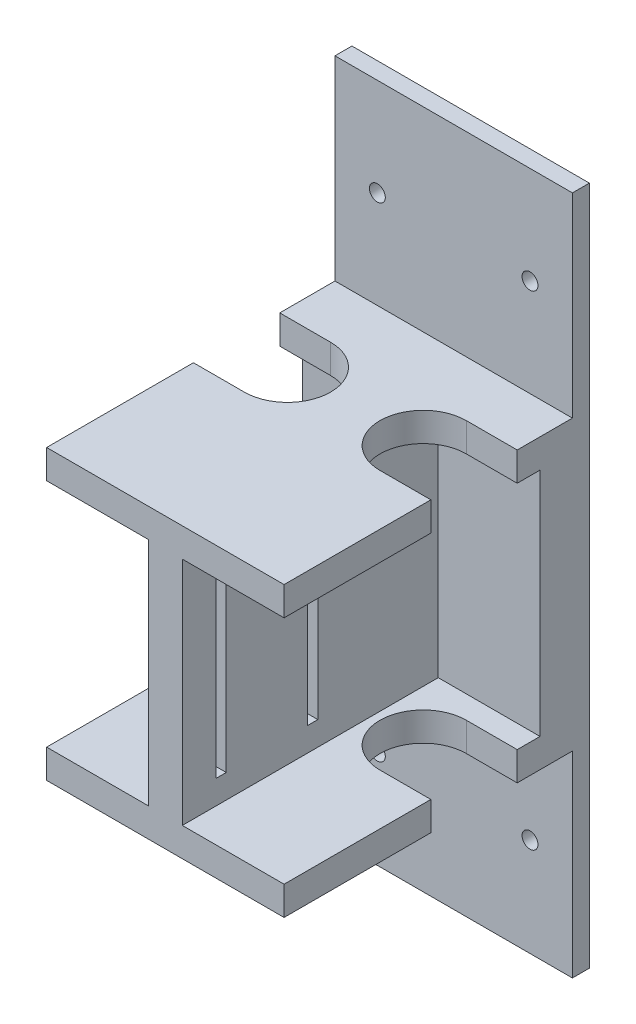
ISO-10303-21;
HEADER;
FILE_DESCRIPTION(('STEP AP214'),'2;1');
FILE_NAME('part.step','',(''),(''),'','','');
FILE_SCHEMA(('AUTOMOTIVE_DESIGN { 1 0 10303 214 1 1 1 1 }'));
ENDSEC;
DATA;
#1=APPLICATION_CONTEXT('core data for automotive mechanical design processes');
#2=APPLICATION_PROTOCOL_DEFINITION('international standard','automotive_design',2000,#1);
#3=PRODUCT_CONTEXT('',#1,'mechanical');
#4=PRODUCT('Part','Part','',(#3));
#5=PRODUCT_RELATED_PRODUCT_CATEGORY('part','',(#4));
#6=PRODUCT_DEFINITION_FORMATION('','',#4);
#7=PRODUCT_DEFINITION_CONTEXT('part definition',#1,'design');
#8=PRODUCT_DEFINITION('design','',#6,#7);
#9=PRODUCT_DEFINITION_SHAPE('','',#8);
#10=(LENGTH_UNIT() NAMED_UNIT(*) SI_UNIT(.MILLI.,.METRE.));
#11=(NAMED_UNIT(*) PLANE_ANGLE_UNIT() SI_UNIT($,.RADIAN.));
#12=(NAMED_UNIT(*) SI_UNIT($,.STERADIAN.) SOLID_ANGLE_UNIT());
#13=UNCERTAINTY_MEASURE_WITH_UNIT(LENGTH_MEASURE(1.E-05),#10,'distance_accuracy_value','');
#14=(GEOMETRIC_REPRESENTATION_CONTEXT(3) GLOBAL_UNCERTAINTY_ASSIGNED_CONTEXT((#13)) GLOBAL_UNIT_ASSIGNED_CONTEXT((#10,
#11,#12)) REPRESENTATION_CONTEXT('',''));
#15=CARTESIAN_POINT('',(0.,0.,0.));
#16=DIRECTION('',(0.,0.,1.));
#17=DIRECTION('',(1.,0.,0.));
#18=AXIS2_PLACEMENT_3D('',#15,#16,#17);
#19=CARTESIAN_POINT('',(17.78,21.59,45.72));
#20=DIRECTION('',(-1.,0.,0.));
#21=DIRECTION('',(0.,-1.,0.));
#22=AXIS2_PLACEMENT_3D('',#19,#20,#21);
#23=PLANE('',#22);
#24=DIRECTION('',(0.,0.,-1.));
#25=VECTOR('',#24,1.);
#26=CARTESIAN_POINT('',(17.78,-21.59,45.72));
#27=LINE('',#26,#25);
#28=CARTESIAN_POINT('',(17.78,-21.59,10.8077));
#29=VERTEX_POINT('',#28);
#30=CARTESIAN_POINT('',(17.78,-21.59,2.54));
#31=VERTEX_POINT('',#30);
#32=EDGE_CURVE('E740',#29,#31,#27,.T.);
#33=ORIENTED_EDGE('',*,*,#32,.T.);
#34=DIRECTION('',(0.,1.,0.));
#35=VECTOR('',#34,1.);
#36=CARTESIAN_POINT('',(17.78,-51.0286,2.54));
#37=LINE('',#36,#35);
#38=CARTESIAN_POINT('',(17.78,-51.0286,2.54));
#39=VERTEX_POINT('',#38);
#40=EDGE_CURVE('E574',#39,#31,#37,.T.);
#41=ORIENTED_EDGE('',*,*,#40,.F.);
#42=DIRECTION('',(0.,0.,-1.));
#43=VECTOR('',#42,1.);
#44=CARTESIAN_POINT('',(17.78,-51.0286,0.));
#45=LINE('',#44,#43);
#46=CARTESIAN_POINT('',(17.78,-51.0286,0.));
#47=VERTEX_POINT('',#46);
#48=EDGE_CURVE('E567',#39,#47,#45,.T.);
#49=ORIENTED_EDGE('',*,*,#48,.T.);
#50=DIRECTION('',(0.,1.,0.));
#51=VECTOR('',#50,1.);
#52=CARTESIAN_POINT('',(17.78,21.59,0.));
#53=LINE('',#52,#51);
#54=CARTESIAN_POINT('',(17.78,50.8,0.));
#55=VERTEX_POINT('',#54);
#56=EDGE_CURVE('E721',#47,#55,#53,.T.);
#57=ORIENTED_EDGE('',*,*,#56,.T.);
#58=DIRECTION('',(0.,0.,-1.));
#59=VECTOR('',#58,1.);
#60=CARTESIAN_POINT('',(17.78,50.8,0.));
#61=LINE('',#60,#59);
#62=CARTESIAN_POINT('',(17.78,50.8,2.54));
#63=VERTEX_POINT('',#62);
#64=EDGE_CURVE('E555',#63,#55,#61,.T.);
#65=ORIENTED_EDGE('',*,*,#64,.F.);
#66=CARTESIAN_POINT('',(17.78,21.59,2.54));
#67=VERTEX_POINT('',#66);
#68=EDGE_CURVE('E577',#67,#63,#37,.T.);
#69=ORIENTED_EDGE('',*,*,#68,.F.);
#70=DIRECTION('',(0.,0.,-1.));
#71=VECTOR('',#70,1.);
#72=CARTESIAN_POINT('',(17.78,21.59,45.72));
#73=LINE('',#72,#71);
#74=CARTESIAN_POINT('',(17.78,21.59,10.8077));
#75=VERTEX_POINT('',#74);
#76=EDGE_CURVE('E755',#75,#67,#73,.T.);
#77=ORIENTED_EDGE('',*,*,#76,.F.);
#78=DIRECTION('',(0.,1.,0.));
#79=VECTOR('',#78,1.);
#80=CARTESIAN_POINT('',(17.78,-21.59,10.8077));
#81=LINE('',#80,#79);
#82=CARTESIAN_POINT('',(17.78,17.272,10.8077));
#83=VERTEX_POINT('',#82);
#84=EDGE_CURVE('E610',#83,#75,#81,.T.);
#85=ORIENTED_EDGE('',*,*,#84,.F.);
#86=DIRECTION('',(0.,0.,1.));
#87=VECTOR('',#86,1.);
#88=CARTESIAN_POINT('',(17.78,17.272,45.72));
#89=LINE('',#88,#87);
#90=CARTESIAN_POINT('',(17.78,17.272,7.3914));
#91=VERTEX_POINT('',#90);
#92=EDGE_CURVE('E700',#91,#83,#89,.T.);
#93=ORIENTED_EDGE('',*,*,#92,.F.);
#94=DIRECTION('',(0.,1.,0.));
#95=VECTOR('',#94,1.);
#96=CARTESIAN_POINT('',(17.78,17.272,7.3914));
#97=LINE('',#96,#95);
#98=CARTESIAN_POINT('',(17.78,-17.272,7.39139999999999));
#99=VERTEX_POINT('',#98);
#100=EDGE_CURVE('E712',#99,#91,#97,.T.);
#101=ORIENTED_EDGE('',*,*,#100,.F.);
#102=DIRECTION('',(0.,0.,-1.));
#103=VECTOR('',#102,1.);
#104=CARTESIAN_POINT('',(17.78,-17.272,45.72));
#105=LINE('',#104,#103);
#106=CARTESIAN_POINT('',(17.78,-17.272,10.8077));
#107=VERTEX_POINT('',#106);
#108=EDGE_CURVE('E689',#107,#99,#105,.T.);
#109=ORIENTED_EDGE('',*,*,#108,.F.);
#110=EDGE_CURVE('E608',#29,#107,#81,.T.);
#111=ORIENTED_EDGE('',*,*,#110,.F.);
#112=EDGE_LOOP('',(#33,#41,#49,#57,#65,#69,#77,#85,#93,#101,#109,#111));
#113=FACE_BOUND('',#112,.T.);
#114=ADVANCED_FACE('F33',(#113),#23,.F.);
#115=CARTESIAN_POINT('',(17.78,-21.59,45.72));
#116=VERTEX_POINT('',#115);
#117=CARTESIAN_POINT('',(17.78,-21.59,23.7363));
#118=VERTEX_POINT('',#117);
#119=EDGE_CURVE('E744',#116,#118,#27,.T.);
#120=ORIENTED_EDGE('',*,*,#119,.T.);
#121=DIRECTION('',(0.,1.,0.));
#122=VECTOR('',#121,1.);
#123=CARTESIAN_POINT('',(17.78,-21.59,23.7363));
#124=LINE('',#123,#122);
#125=CARTESIAN_POINT('',(17.78,-17.272,23.7363));
#126=VERTEX_POINT('',#125);
#127=EDGE_CURVE('E611',#118,#126,#124,.T.);
#128=ORIENTED_EDGE('',*,*,#127,.T.);
#129=CARTESIAN_POINT('',(17.78,-17.272,45.72));
#130=VERTEX_POINT('',#129);
#131=EDGE_CURVE('E709',#130,#126,#105,.T.);
#132=ORIENTED_EDGE('',*,*,#131,.F.);
#133=DIRECTION('',(0.,1.,0.));
#134=VECTOR('',#133,1.);
#135=CARTESIAN_POINT('',(17.78,21.59,45.72));
#136=LINE('',#135,#134);
#137=EDGE_CURVE('E728',#116,#130,#136,.T.);
#138=ORIENTED_EDGE('',*,*,#137,.F.);
#139=EDGE_LOOP('',(#120,#128,#132,#138));
#140=FACE_BOUND('',#139,.T.);
#141=ADVANCED_FACE('F847',(#140),#23,.F.);
#142=CARTESIAN_POINT('',(-17.78,21.59,45.72));
#143=DIRECTION('',(0.,-1.,0.));
#144=DIRECTION('',(0.,0.,-1.));
#145=AXIS2_PLACEMENT_3D('',#142,#143,#144);
#146=PLANE('',#145);
#147=ORIENTED_EDGE('',*,*,#76,.T.);
#148=DIRECTION('',(-1.,0.,0.));
#149=VECTOR('',#148,1.);
#150=CARTESIAN_POINT('',(-17.78,21.59,2.54));
#151=LINE('',#150,#149);
#152=CARTESIAN_POINT('',(-17.78,21.59,2.54));
#153=VERTEX_POINT('',#152);
#154=EDGE_CURVE('E583',#67,#153,#151,.T.);
#155=ORIENTED_EDGE('',*,*,#154,.T.);
#156=DIRECTION('',(0.,0.,-1.));
#157=VECTOR('',#156,1.);
#158=CARTESIAN_POINT('',(-17.78,21.59,45.72));
#159=LINE('',#158,#157);
#160=CARTESIAN_POINT('',(-17.78,21.59,10.8077));
#161=VERTEX_POINT('',#160);
#162=EDGE_CURVE('E751',#161,#153,#159,.T.);
#163=ORIENTED_EDGE('',*,*,#162,.F.);
#164=DIRECTION('',(1.,0.,0.));
#165=VECTOR('',#164,1.);
#166=CARTESIAN_POINT('',(0.,21.59,10.8077));
#167=LINE('',#166,#165);
#168=CARTESIAN_POINT('',(-10.16,21.59,10.8077));
#169=VERTEX_POINT('',#168);
#170=EDGE_CURVE('E629',#161,#169,#167,.T.);
#171=ORIENTED_EDGE('',*,*,#170,.T.);
#172=CARTESIAN_POINT('',(-10.16,21.59,17.272));
#173=DIRECTION('',(0.,1.,0.));
#174=DIRECTION('',(0.,0.,1.));
#175=AXIS2_PLACEMENT_3D('',#172,#173,#174);
#176=CIRCLE('',#175,6.4643);
#177=CARTESIAN_POINT('',(-10.16,21.59,23.7363));
#178=VERTEX_POINT('',#177);
#179=EDGE_CURVE('E637',#178,#169,#176,.T.);
#180=ORIENTED_EDGE('',*,*,#179,.F.);
#181=DIRECTION('',(1.,0.,0.));
#182=VECTOR('',#181,1.);
#183=CARTESIAN_POINT('',(0.,21.59,23.7363));
#184=LINE('',#183,#182);
#185=CARTESIAN_POINT('',(-17.78,21.59,23.7363));
#186=VERTEX_POINT('',#185);
#187=EDGE_CURVE('E624',#186,#178,#184,.T.);
#188=ORIENTED_EDGE('',*,*,#187,.F.);
#189=CARTESIAN_POINT('',(-17.78,21.59,45.72));
#190=VERTEX_POINT('',#189);
#191=EDGE_CURVE('E752',#190,#186,#159,.T.);
#192=ORIENTED_EDGE('',*,*,#191,.F.);
#193=DIRECTION('',(-1.,0.,0.));
#194=VECTOR('',#193,1.);
#195=CARTESIAN_POINT('',(-17.78,21.59,45.72));
#196=LINE('',#195,#194);
#197=CARTESIAN_POINT('',(17.78,21.59,45.72));
#198=VERTEX_POINT('',#197);
#199=EDGE_CURVE('E731',#198,#190,#196,.T.);
#200=ORIENTED_EDGE('',*,*,#199,.F.);
#201=CARTESIAN_POINT('',(17.78,21.59,23.7363));
#202=VERTEX_POINT('',#201);
#203=EDGE_CURVE('E756',#198,#202,#73,.T.);
#204=ORIENTED_EDGE('',*,*,#203,.T.);
#205=DIRECTION('',(1.,0.,0.));
#206=VECTOR('',#205,1.);
#207=CARTESIAN_POINT('',(0.,21.59,23.7363));
#208=LINE('',#207,#206);
#209=CARTESIAN_POINT('',(10.16,21.59,23.7363));
#210=VERTEX_POINT('',#209);
#211=EDGE_CURVE('E599',#210,#202,#208,.T.);
#212=ORIENTED_EDGE('',*,*,#211,.F.);
#213=CARTESIAN_POINT('',(10.16,21.59,17.272));
#214=DIRECTION('',(0.,1.,0.));
#215=DIRECTION('',(0.,0.,1.));
#216=AXIS2_PLACEMENT_3D('',#213,#214,#215);
#217=CIRCLE('',#216,6.4643);
#218=CARTESIAN_POINT('',(10.16,21.59,10.8077));
#219=VERTEX_POINT('',#218);
#220=EDGE_CURVE('E586',#219,#210,#217,.T.);
#221=ORIENTED_EDGE('',*,*,#220,.F.);
#222=DIRECTION('',(1.,0.,0.));
#223=VECTOR('',#222,1.);
#224=CARTESIAN_POINT('',(0.,21.59,10.8077));
#225=LINE('',#224,#223);
#226=EDGE_CURVE('E591',#219,#75,#225,.T.);
#227=ORIENTED_EDGE('',*,*,#226,.T.);
#228=EDGE_LOOP('',(#147,#155,#163,#171,#180,#188,#192,#200,#204,#212,#221,#227));
#229=FACE_BOUND('',#228,.T.);
#230=ADVANCED_FACE('F819',(#229),#146,.F.);
#231=CARTESIAN_POINT('',(-17.78,-21.59,45.72));
#232=DIRECTION('',(0.,1.,0.));
#233=DIRECTION('',(0.,0.,1.));
#234=AXIS2_PLACEMENT_3D('',#231,#232,#233);
#235=PLANE('',#234);
#236=DIRECTION('',(0.,0.,-1.));
#237=VECTOR('',#236,1.);
#238=CARTESIAN_POINT('',(-17.78,-21.59,45.72));
#239=LINE('',#238,#237);
#240=CARTESIAN_POINT('',(-17.78,-21.59,10.8077));
#241=VERTEX_POINT('',#240);
#242=CARTESIAN_POINT('',(-17.78,-21.59,2.54));
#243=VERTEX_POINT('',#242);
#244=EDGE_CURVE('E747',#241,#243,#239,.T.);
#245=ORIENTED_EDGE('',*,*,#244,.T.);
#246=DIRECTION('',(1.,0.,0.));
#247=VECTOR('',#246,1.);
#248=CARTESIAN_POINT('',(-17.78,-21.59,2.54));
#249=LINE('',#248,#247);
#250=EDGE_CURVE('E576',#243,#31,#249,.T.);
#251=ORIENTED_EDGE('',*,*,#250,.T.);
#252=ORIENTED_EDGE('',*,*,#32,.F.);
#253=DIRECTION('',(1.,0.,0.));
#254=VECTOR('',#253,1.);
#255=CARTESIAN_POINT('',(0.,-21.59,10.8077));
#256=LINE('',#255,#254);
#257=CARTESIAN_POINT('',(10.16,-21.59,10.8077));
#258=VERTEX_POINT('',#257);
#259=EDGE_CURVE('E594',#258,#29,#256,.T.);
#260=ORIENTED_EDGE('',*,*,#259,.F.);
#261=CARTESIAN_POINT('',(10.16,-21.59,17.272));
#262=DIRECTION('',(0.,1.,0.));
#263=DIRECTION('',(0.,0.,1.));
#264=AXIS2_PLACEMENT_3D('',#261,#262,#263);
#265=CIRCLE('',#264,6.4643);
#266=CARTESIAN_POINT('',(10.16,-21.59,23.7363));
#267=VERTEX_POINT('',#266);
#268=EDGE_CURVE('E587',#258,#267,#265,.T.);
#269=ORIENTED_EDGE('',*,*,#268,.T.);
#270=DIRECTION('',(1.,0.,0.));
#271=VECTOR('',#270,1.);
#272=CARTESIAN_POINT('',(0.,-21.59,23.7363));
#273=LINE('',#272,#271);
#274=EDGE_CURVE('E590',#267,#118,#273,.T.);
#275=ORIENTED_EDGE('',*,*,#274,.T.);
#276=ORIENTED_EDGE('',*,*,#119,.F.);
#277=DIRECTION('',(1.,0.,0.));
#278=VECTOR('',#277,1.);
#279=CARTESIAN_POINT('',(-17.78,-21.59,45.72));
#280=LINE('',#279,#278);
#281=CARTESIAN_POINT('',(-17.78,-21.59,45.72));
#282=VERTEX_POINT('',#281);
#283=EDGE_CURVE('E738',#282,#116,#280,.T.);
#284=ORIENTED_EDGE('',*,*,#283,.F.);
#285=CARTESIAN_POINT('',(-17.78,-21.59,23.7363));
#286=VERTEX_POINT('',#285);
#287=EDGE_CURVE('E748',#282,#286,#239,.T.);
#288=ORIENTED_EDGE('',*,*,#287,.T.);
#289=DIRECTION('',(1.,0.,0.));
#290=VECTOR('',#289,1.);
#291=CARTESIAN_POINT('',(0.,-21.59,23.7363));
#292=LINE('',#291,#290);
#293=CARTESIAN_POINT('',(-10.16,-21.59,23.7363));
#294=VERTEX_POINT('',#293);
#295=EDGE_CURVE('E625',#286,#294,#292,.T.);
#296=ORIENTED_EDGE('',*,*,#295,.T.);
#297=CARTESIAN_POINT('',(-10.16,-21.59,17.272));
#298=DIRECTION('',(0.,1.,0.));
#299=DIRECTION('',(0.,0.,1.));
#300=AXIS2_PLACEMENT_3D('',#297,#298,#299);
#301=CIRCLE('',#300,6.4643);
#302=CARTESIAN_POINT('',(-10.16,-21.59,10.8077));
#303=VERTEX_POINT('',#302);
#304=EDGE_CURVE('E628',#294,#303,#301,.T.);
#305=ORIENTED_EDGE('',*,*,#304,.T.);
#306=DIRECTION('',(1.,0.,0.));
#307=VECTOR('',#306,1.);
#308=CARTESIAN_POINT('',(0.,-21.59,10.8077));
#309=LINE('',#308,#307);
#310=EDGE_CURVE('E632',#241,#303,#309,.T.);
#311=ORIENTED_EDGE('',*,*,#310,.F.);
#312=EDGE_LOOP('',(#245,#251,#252,#260,#269,#275,#276,#284,#288,#296,#305,#311));
#313=FACE_BOUND('',#312,.T.);
#314=ADVANCED_FACE('F790',(#313),#235,.F.);
#315=CARTESIAN_POINT('',(2.54,17.272,45.72));
#316=DIRECTION('',(0.,1.,0.));
#317=DIRECTION('',(-1.,0.,0.));
#318=AXIS2_PLACEMENT_3D('',#315,#316,#317);
#319=PLANE('',#318);
#320=DIRECTION('',(1.,0.,0.));
#321=VECTOR('',#320,1.);
#322=CARTESIAN_POINT('',(2.54,17.272,10.8077));
#323=LINE('',#322,#321);
#324=CARTESIAN_POINT('',(10.16,17.272,10.8077));
#325=VERTEX_POINT('',#324);
#326=EDGE_CURVE('E619',#325,#83,#323,.T.);
#327=ORIENTED_EDGE('',*,*,#326,.F.);
#328=CARTESIAN_POINT('',(10.16,17.272,17.272));
#329=DIRECTION('',(0.,1.,0.));
#330=DIRECTION('',(-1.,0.,0.));
#331=AXIS2_PLACEMENT_3D('',#328,#329,#330);
#332=CIRCLE('',#331,6.4643);
#333=CARTESIAN_POINT('',(10.16,17.272,23.7363));
#334=VERTEX_POINT('',#333);
#335=EDGE_CURVE('E621',#325,#334,#332,.T.);
#336=ORIENTED_EDGE('',*,*,#335,.T.);
#337=DIRECTION('',(1.,0.,0.));
#338=VECTOR('',#337,1.);
#339=CARTESIAN_POINT('',(2.54,17.272,23.7363));
#340=LINE('',#339,#338);
#341=CARTESIAN_POINT('',(17.78,17.272,23.7363));
#342=VERTEX_POINT('',#341);
#343=EDGE_CURVE('E606',#334,#342,#340,.T.);
#344=ORIENTED_EDGE('',*,*,#343,.T.);
#345=CARTESIAN_POINT('',(17.78,17.272,45.72));
#346=VERTEX_POINT('',#345);
#347=EDGE_CURVE('E715',#342,#346,#89,.T.);
#348=ORIENTED_EDGE('',*,*,#347,.T.);
#349=DIRECTION('',(1.,0.,0.));
#350=VECTOR('',#349,1.);
#351=CARTESIAN_POINT('',(2.54,17.272,45.72));
#352=LINE('',#351,#350);
#353=CARTESIAN_POINT('',(2.54,17.272,45.72));
#354=VERTEX_POINT('',#353);
#355=EDGE_CURVE('E718',#354,#346,#352,.T.);
#356=ORIENTED_EDGE('',*,*,#355,.F.);
#357=DIRECTION('',(0.,0.,1.));
#358=VECTOR('',#357,1.);
#359=CARTESIAN_POINT('',(2.54,17.272,45.72));
#360=LINE('',#359,#358);
#361=CARTESIAN_POINT('',(2.54,17.272,7.3914));
#362=VERTEX_POINT('',#361);
#363=EDGE_CURVE('E706',#362,#354,#360,.T.);
#364=ORIENTED_EDGE('',*,*,#363,.F.);
#365=DIRECTION('',(1.,0.,0.));
#366=VECTOR('',#365,1.);
#367=CARTESIAN_POINT('',(2.54,17.272,7.3914));
#368=LINE('',#367,#366);
#369=EDGE_CURVE('E722',#362,#91,#368,.T.);
#370=ORIENTED_EDGE('',*,*,#369,.T.);
#371=ORIENTED_EDGE('',*,*,#92,.T.);
#372=EDGE_LOOP('',(#327,#336,#344,#348,#356,#364,#370,#371));
#373=FACE_BOUND('',#372,.T.);
#374=ADVANCED_FACE('F830',(#373),#319,.F.);
#375=CARTESIAN_POINT('',(2.54,-17.272,45.72));
#376=DIRECTION('',(0.,-1.,0.));
#377=DIRECTION('',(1.,0.,0.));
#378=AXIS2_PLACEMENT_3D('',#375,#376,#377);
#379=PLANE('',#378);
#380=DIRECTION('',(-1.,0.,0.));
#381=VECTOR('',#380,1.);
#382=CARTESIAN_POINT('',(2.54,-17.272,10.8077));
#383=LINE('',#382,#381);
#384=CARTESIAN_POINT('',(10.16,-17.272,10.8077));
#385=VERTEX_POINT('',#384);
#386=EDGE_CURVE('E11',#107,#385,#383,.T.);
#387=ORIENTED_EDGE('',*,*,#386,.F.);
#388=ORIENTED_EDGE('',*,*,#108,.T.);
#389=DIRECTION('',(1.,0.,0.));
#390=VECTOR('',#389,1.);
#391=CARTESIAN_POINT('',(2.54,-17.272,7.39139999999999));
#392=LINE('',#391,#390);
#393=CARTESIAN_POINT('',(2.54,-17.272,7.39139999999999));
#394=VERTEX_POINT('',#393);
#395=EDGE_CURVE('E724',#394,#99,#392,.T.);
#396=ORIENTED_EDGE('',*,*,#395,.F.);
#397=DIRECTION('',(0.,0.,-1.));
#398=VECTOR('',#397,1.);
#399=CARTESIAN_POINT('',(2.54,-17.272,45.72));
#400=LINE('',#399,#398);
#401=CARTESIAN_POINT('',(2.54,-17.272,45.72));
#402=VERTEX_POINT('',#401);
#403=EDGE_CURVE('E699',#402,#394,#400,.T.);
#404=ORIENTED_EDGE('',*,*,#403,.F.);
#405=DIRECTION('',(1.,0.,0.));
#406=VECTOR('',#405,1.);
#407=CARTESIAN_POINT('',(2.54,-17.272,45.72));
#408=LINE('',#407,#406);
#409=EDGE_CURVE('E708',#402,#130,#408,.T.);
#410=ORIENTED_EDGE('',*,*,#409,.T.);
#411=ORIENTED_EDGE('',*,*,#131,.T.);
#412=DIRECTION('',(-1.,0.,0.));
#413=VECTOR('',#412,1.);
#414=CARTESIAN_POINT('',(2.54,-17.272,23.7363));
#415=LINE('',#414,#413);
#416=CARTESIAN_POINT('',(10.16,-17.272,23.7363));
#417=VERTEX_POINT('',#416);
#418=EDGE_CURVE('E768',#126,#417,#415,.T.);
#419=ORIENTED_EDGE('',*,*,#418,.T.);
#420=CARTESIAN_POINT('',(10.16,-17.272,17.272));
#421=DIRECTION('',(0.,-1.,0.));
#422=DIRECTION('',(1.,0.,0.));
#423=AXIS2_PLACEMENT_3D('',#420,#421,#422);
#424=CIRCLE('',#423,6.4643);
#425=EDGE_CURVE('E41',#417,#385,#424,.T.);
#426=ORIENTED_EDGE('',*,*,#425,.T.);
#427=EDGE_LOOP('',(#387,#388,#396,#404,#410,#411,#419,#426));
#428=FACE_BOUND('',#427,.T.);
#429=ADVANCED_FACE('F774',(#428),#379,.F.);
#430=CARTESIAN_POINT('',(-17.78,21.59,45.72));
#431=DIRECTION('',(1.,0.,0.));
#432=DIRECTION('',(0.,1.,0.));
#433=AXIS2_PLACEMENT_3D('',#430,#431,#432);
#434=PLANE('',#433);
#435=ORIENTED_EDGE('',*,*,#162,.T.);
#436=DIRECTION('',(0.,1.,0.));
#437=VECTOR('',#436,1.);
#438=CARTESIAN_POINT('',(-17.78,-51.0286,2.54));
#439=LINE('',#438,#437);
#440=CARTESIAN_POINT('',(-17.78,50.8,2.54));
#441=VERTEX_POINT('',#440);
#442=EDGE_CURVE('E573',#153,#441,#439,.T.);
#443=ORIENTED_EDGE('',*,*,#442,.T.);
#444=DIRECTION('',(0.,0.,1.));
#445=VECTOR('',#444,1.);
#446=CARTESIAN_POINT('',(-17.78,50.8,0.));
#447=LINE('',#446,#445);
#448=CARTESIAN_POINT('',(-17.78,50.8,0.));
#449=VERTEX_POINT('',#448);
#450=EDGE_CURVE('E547',#449,#441,#447,.T.);
#451=ORIENTED_EDGE('',*,*,#450,.F.);
#452=DIRECTION('',(0.,-1.,0.));
#453=VECTOR('',#452,1.);
#454=CARTESIAN_POINT('',(-17.78,21.59,0.));
#455=LINE('',#454,#453);
#456=CARTESIAN_POINT('',(-17.78,-51.0286,0.));
#457=VERTEX_POINT('',#456);
#458=EDGE_CURVE('E742',#449,#457,#455,.T.);
#459=ORIENTED_EDGE('',*,*,#458,.T.);
#460=DIRECTION('',(0.,0.,1.));
#461=VECTOR('',#460,1.);
#462=CARTESIAN_POINT('',(-17.78,-51.0286,0.));
#463=LINE('',#462,#461);
#464=CARTESIAN_POINT('',(-17.78,-51.0286,2.54));
#465=VERTEX_POINT('',#464);
#466=EDGE_CURVE('E561',#457,#465,#463,.T.);
#467=ORIENTED_EDGE('',*,*,#466,.T.);
#468=EDGE_CURVE('E578',#465,#243,#439,.T.);
#469=ORIENTED_EDGE('',*,*,#468,.T.);
#470=ORIENTED_EDGE('',*,*,#244,.F.);
#471=DIRECTION('',(0.,1.,0.));
#472=VECTOR('',#471,1.);
#473=CARTESIAN_POINT('',(-17.78,-21.59,10.8077));
#474=LINE('',#473,#472);
#475=CARTESIAN_POINT('',(-17.78,-17.272,10.8077));
#476=VERTEX_POINT('',#475);
#477=EDGE_CURVE('E646',#241,#476,#474,.T.);
#478=ORIENTED_EDGE('',*,*,#477,.T.);
#479=DIRECTION('',(0.,0.,1.));
#480=VECTOR('',#479,1.);
#481=CARTESIAN_POINT('',(-17.78,-17.272,7.3914));
#482=LINE('',#481,#480);
#483=CARTESIAN_POINT('',(-17.78,-17.272,7.3914));
#484=VERTEX_POINT('',#483);
#485=EDGE_CURVE('E668',#484,#476,#482,.T.);
#486=ORIENTED_EDGE('',*,*,#485,.F.);
#487=DIRECTION('',(0.,-1.,0.));
#488=VECTOR('',#487,1.);
#489=CARTESIAN_POINT('',(-17.78,17.272,7.3914));
#490=LINE('',#489,#488);
#491=CARTESIAN_POINT('',(-17.78,17.272,7.3914));
#492=VERTEX_POINT('',#491);
#493=EDGE_CURVE('E680',#492,#484,#490,.T.);
#494=ORIENTED_EDGE('',*,*,#493,.F.);
#495=DIRECTION('',(0.,0.,-1.));
#496=VECTOR('',#495,1.);
#497=CARTESIAN_POINT('',(-17.78,17.272,7.3914));
#498=LINE('',#497,#496);
#499=CARTESIAN_POINT('',(-17.78,17.272,10.8077));
#500=VERTEX_POINT('',#499);
#501=EDGE_CURVE('E663',#500,#492,#498,.T.);
#502=ORIENTED_EDGE('',*,*,#501,.F.);
#503=EDGE_CURVE('E649',#500,#161,#474,.T.);
#504=ORIENTED_EDGE('',*,*,#503,.T.);
#505=EDGE_LOOP('',(#435,#443,#451,#459,#467,#469,#470,#478,#486,#494,#502,#504));
#506=FACE_BOUND('',#505,.T.);
#507=ADVANCED_FACE('F798',(#506),#434,.F.);
#508=ORIENTED_EDGE('',*,*,#191,.T.);
#509=DIRECTION('',(0.,1.,0.));
#510=VECTOR('',#509,1.);
#511=CARTESIAN_POINT('',(-17.78,-21.59,23.7363));
#512=LINE('',#511,#510);
#513=CARTESIAN_POINT('',(-17.78,17.272,23.7363));
#514=VERTEX_POINT('',#513);
#515=EDGE_CURVE('E645',#514,#186,#512,.T.);
#516=ORIENTED_EDGE('',*,*,#515,.F.);
#517=CARTESIAN_POINT('',(-17.78,17.272,45.72));
#518=VERTEX_POINT('',#517);
#519=EDGE_CURVE('E677',#518,#514,#498,.T.);
#520=ORIENTED_EDGE('',*,*,#519,.F.);
#521=DIRECTION('',(0.,-1.,0.));
#522=VECTOR('',#521,1.);
#523=CARTESIAN_POINT('',(-17.78,21.59,45.72));
#524=LINE('',#523,#522);
#525=EDGE_CURVE('E735',#190,#518,#524,.T.);
#526=ORIENTED_EDGE('',*,*,#525,.F.);
#527=EDGE_LOOP('',(#508,#516,#520,#526));
#528=FACE_BOUND('',#527,.T.);
#529=ADVANCED_FACE('F893',(#528),#434,.F.);
#530=ORIENTED_EDGE('',*,*,#347,.F.);
#531=EDGE_CURVE('E614',#342,#202,#124,.T.);
#532=ORIENTED_EDGE('',*,*,#531,.T.);
#533=ORIENTED_EDGE('',*,*,#203,.F.);
#534=EDGE_CURVE('E732',#346,#198,#136,.T.);
#535=ORIENTED_EDGE('',*,*,#534,.F.);
#536=EDGE_LOOP('',(#530,#532,#533,#535));
#537=FACE_BOUND('',#536,.T.);
#538=ADVANCED_FACE('F35',(#537),#23,.F.);
#539=CARTESIAN_POINT('',(-17.78,-17.272,23.7363));
#540=VERTEX_POINT('',#539);
#541=CARTESIAN_POINT('',(-17.78,-17.272,45.72));
#542=VERTEX_POINT('',#541);
#543=EDGE_CURVE('E683',#540,#542,#482,.T.);
#544=ORIENTED_EDGE('',*,*,#543,.F.);
#545=EDGE_CURVE('E642',#286,#540,#512,.T.);
#546=ORIENTED_EDGE('',*,*,#545,.F.);
#547=ORIENTED_EDGE('',*,*,#287,.F.);
#548=EDGE_CURVE('E734',#542,#282,#524,.T.);
#549=ORIENTED_EDGE('',*,*,#548,.F.);
#550=EDGE_LOOP('',(#544,#546,#547,#549));
#551=FACE_BOUND('',#550,.T.);
#552=ADVANCED_FACE('F855',(#551),#434,.F.);
#553=CARTESIAN_POINT('',(0.,0.,45.72));
#554=DIRECTION('',(0.,0.,1.));
#555=DIRECTION('',(1.,0.,0.));
#556=AXIS2_PLACEMENT_3D('',#553,#554,#555);
#557=PLANE('',#556);
#558=DIRECTION('',(-1.,0.,0.));
#559=VECTOR('',#558,1.);
#560=CARTESIAN_POINT('',(-2.54,-17.272,45.72));
#561=LINE('',#560,#559);
#562=CARTESIAN_POINT('',(-2.54,-17.272,45.72));
#563=VERTEX_POINT('',#562);
#564=EDGE_CURVE('E686',#563,#542,#561,.T.);
#565=ORIENTED_EDGE('',*,*,#564,.T.);
#566=ORIENTED_EDGE('',*,*,#548,.T.);
#567=ORIENTED_EDGE('',*,*,#283,.T.);
#568=ORIENTED_EDGE('',*,*,#137,.T.);
#569=ORIENTED_EDGE('',*,*,#409,.F.);
#570=DIRECTION('',(0.,-1.,0.));
#571=VECTOR('',#570,1.);
#572=CARTESIAN_POINT('',(2.54,17.272,45.72));
#573=LINE('',#572,#571);
#574=EDGE_CURVE('E696',#354,#402,#573,.T.);
#575=ORIENTED_EDGE('',*,*,#574,.F.);
#576=ORIENTED_EDGE('',*,*,#355,.T.);
#577=ORIENTED_EDGE('',*,*,#534,.T.);
#578=ORIENTED_EDGE('',*,*,#199,.T.);
#579=ORIENTED_EDGE('',*,*,#525,.T.);
#580=DIRECTION('',(-1.,0.,0.));
#581=VECTOR('',#580,1.);
#582=CARTESIAN_POINT('',(-2.54,17.272,45.72));
#583=LINE('',#582,#581);
#584=CARTESIAN_POINT('',(-2.54,17.272,45.72));
#585=VERTEX_POINT('',#584);
#586=EDGE_CURVE('E676',#585,#518,#583,.T.);
#587=ORIENTED_EDGE('',*,*,#586,.F.);
#588=DIRECTION('',(0.,1.,0.));
#589=VECTOR('',#588,1.);
#590=CARTESIAN_POINT('',(-2.54,17.272,45.72));
#591=LINE('',#590,#589);
#592=EDGE_CURVE('E664',#563,#585,#591,.T.);
#593=ORIENTED_EDGE('',*,*,#592,.F.);
#594=EDGE_LOOP('',(#565,#566,#567,#568,#569,#575,#576,#577,#578,#579,#587,#593));
#595=FACE_BOUND('',#594,.T.);
#596=ADVANCED_FACE('F842',(#595),#557,.T.);
#597=CARTESIAN_POINT('',(0.,0.,0.));
#598=DIRECTION('',(0.,0.,1.));
#599=DIRECTION('',(1.,0.,0.));
#600=AXIS2_PLACEMENT_3D('',#597,#598,#599);
#601=PLANE('',#600);
#602=CARTESIAN_POINT('',(11.43,-36.3093,0.));
#603=DIRECTION('',(0.,0.,1.));
#604=DIRECTION('',(1.,0.,0.));
#605=AXIS2_PLACEMENT_3D('',#602,#603,#604);
#606=CIRCLE('',#605,1.190625);
#607=CARTESIAN_POINT('',(12.620625,-36.3093,0.));
#608=VERTEX_POINT('',#607);
#609=EDGE_CURVE('E526',#608,#608,#606,.T.);
#610=ORIENTED_EDGE('',*,*,#609,.T.);
#611=EDGE_LOOP('',(#610));
#612=FACE_BOUND('',#611,.T.);
#613=CARTESIAN_POINT('',(-11.43,-36.3093,0.));
#614=DIRECTION('',(0.,0.,1.));
#615=DIRECTION('',(1.,0.,0.));
#616=AXIS2_PLACEMENT_3D('',#613,#614,#615);
#617=CIRCLE('',#616,1.190625);
#618=CARTESIAN_POINT('',(-10.239375,-36.3093,0.));
#619=VERTEX_POINT('',#618);
#620=EDGE_CURVE('E532',#619,#619,#617,.T.);
#621=ORIENTED_EDGE('',*,*,#620,.T.);
#622=EDGE_LOOP('',(#621));
#623=FACE_BOUND('',#622,.T.);
#624=CARTESIAN_POINT('',(11.43,36.195,0.));
#625=DIRECTION('',(0.,0.,1.));
#626=DIRECTION('',(1.,0.,0.));
#627=AXIS2_PLACEMENT_3D('',#624,#625,#626);
#628=CIRCLE('',#627,1.190625);
#629=CARTESIAN_POINT('',(12.620625,36.195,0.));
#630=VERTEX_POINT('',#629);
#631=EDGE_CURVE('E538',#630,#630,#628,.T.);
#632=ORIENTED_EDGE('',*,*,#631,.T.);
#633=EDGE_LOOP('',(#632));
#634=FACE_BOUND('',#633,.T.);
#635=CARTESIAN_POINT('',(-11.43,36.195,0.));
#636=DIRECTION('',(0.,0.,1.));
#637=DIRECTION('',(1.,0.,0.));
#638=AXIS2_PLACEMENT_3D('',#635,#636,#637);
#639=CIRCLE('',#638,1.190625);
#640=CARTESIAN_POINT('',(-10.239375,36.195,0.));
#641=VERTEX_POINT('',#640);
#642=EDGE_CURVE('E544',#641,#641,#639,.T.);
#643=ORIENTED_EDGE('',*,*,#642,.T.);
#644=EDGE_LOOP('',(#643));
#645=FACE_BOUND('',#644,.T.);
#646=ORIENTED_EDGE('',*,*,#56,.F.);
#647=DIRECTION('',(-1.,0.,0.));
#648=VECTOR('',#647,1.);
#649=CARTESIAN_POINT('',(-17.78,-51.0286,0.));
#650=LINE('',#649,#648);
#651=EDGE_CURVE('E570',#47,#457,#650,.T.);
#652=ORIENTED_EDGE('',*,*,#651,.T.);
#653=ORIENTED_EDGE('',*,*,#458,.F.);
#654=DIRECTION('',(-1.,0.,0.));
#655=VECTOR('',#654,1.);
#656=CARTESIAN_POINT('',(-17.78,50.8,0.));
#657=LINE('',#656,#655);
#658=EDGE_CURVE('E558',#55,#449,#657,.T.);
#659=ORIENTED_EDGE('',*,*,#658,.F.);
#660=EDGE_LOOP('',(#646,#652,#653,#659));
#661=FACE_BOUND('',#660,.T.);
#662=ADVANCED_FACE('F806',(#612,#623,#634,#645,#661),#601,.F.);
#663=CARTESIAN_POINT('',(2.54,17.272,7.3914));
#664=DIRECTION('',(0.,0.,-1.));
#665=DIRECTION('',(0.,1.,0.));
#666=AXIS2_PLACEMENT_3D('',#663,#664,#665);
#667=PLANE('',#666);
#668=ORIENTED_EDGE('',*,*,#100,.T.);
#669=ORIENTED_EDGE('',*,*,#369,.F.);
#670=DIRECTION('',(0.,1.,0.));
#671=VECTOR('',#670,1.);
#672=CARTESIAN_POINT('',(2.54,17.272,7.3914));
#673=LINE('',#672,#671);
#674=EDGE_CURVE('E703',#394,#362,#673,.T.);
#675=ORIENTED_EDGE('',*,*,#674,.F.);
#676=ORIENTED_EDGE('',*,*,#395,.T.);
#677=EDGE_LOOP('',(#668,#669,#675,#676));
#678=FACE_BOUND('',#677,.T.);
#679=ADVANCED_FACE('F835',(#678),#667,.F.);
#680=CARTESIAN_POINT('',(2.54,0.,0.));
#681=DIRECTION('',(1.,0.,0.));
#682=DIRECTION('',(0.,1.,0.));
#683=AXIS2_PLACEMENT_3D('',#680,#681,#682);
#684=PLANE('',#683);
#685=DIRECTION('',(0.,-1.,0.));
#686=VECTOR('',#685,1.);
#687=CARTESIAN_POINT('',(2.54,13.6906,40.6654));
#688=LINE('',#687,#686);
#689=CARTESIAN_POINT('',(2.54,13.6906,40.6654));
#690=VERTEX_POINT('',#689);
#691=CARTESIAN_POINT('',(2.54,-13.6906,40.6654));
#692=VERTEX_POINT('',#691);
#693=EDGE_CURVE('E48',#690,#692,#688,.T.);
#694=ORIENTED_EDGE('',*,*,#693,.F.);
#695=DIRECTION('',(0.,0.,1.));
#696=VECTOR('',#695,1.);
#697=CARTESIAN_POINT('',(2.54,13.6906,40.6654));
#698=LINE('',#697,#696);
#699=CARTESIAN_POINT('',(2.54,13.6906,39.1414));
#700=VERTEX_POINT('',#699);
#701=EDGE_CURVE('E381',#700,#690,#698,.T.);
#702=ORIENTED_EDGE('',*,*,#701,.F.);
#703=DIRECTION('',(0.,1.,0.));
#704=VECTOR('',#703,1.);
#705=CARTESIAN_POINT('',(2.54,13.6906,39.1414));
#706=LINE('',#705,#704);
#707=CARTESIAN_POINT('',(2.54,-13.6906,39.1414));
#708=VERTEX_POINT('',#707);
#709=EDGE_CURVE('E384',#708,#700,#706,.T.);
#710=ORIENTED_EDGE('',*,*,#709,.F.);
#711=DIRECTION('',(0.,0.,-1.));
#712=VECTOR('',#711,1.);
#713=CARTESIAN_POINT('',(2.54,-13.6906,40.6654));
#714=LINE('',#713,#712);
#715=EDGE_CURVE('E390',#692,#708,#714,.T.);
#716=ORIENTED_EDGE('',*,*,#715,.F.);
#717=EDGE_LOOP('',(#694,#702,#710,#716));
#718=FACE_BOUND('',#717,.T.);
#719=DIRECTION('',(0.,-1.,0.));
#720=VECTOR('',#719,1.);
#721=CARTESIAN_POINT('',(2.54,13.6906,26.9494));
#722=LINE('',#721,#720);
#723=CARTESIAN_POINT('',(2.54,13.6906,26.9494));
#724=VERTEX_POINT('',#723);
#725=CARTESIAN_POINT('',(2.54,-13.6906,26.9494));
#726=VERTEX_POINT('',#725);
#727=EDGE_CURVE('E56',#724,#726,#722,.T.);
#728=ORIENTED_EDGE('',*,*,#727,.F.);
#729=DIRECTION('',(0.,0.,1.));
#730=VECTOR('',#729,1.);
#731=CARTESIAN_POINT('',(2.54,13.6906,26.9494));
#732=LINE('',#731,#730);
#733=CARTESIAN_POINT('',(2.54,13.6906,25.4254));
#734=VERTEX_POINT('',#733);
#735=EDGE_CURVE('E403',#734,#724,#732,.T.);
#736=ORIENTED_EDGE('',*,*,#735,.F.);
#737=DIRECTION('',(0.,1.,0.));
#738=VECTOR('',#737,1.);
#739=CARTESIAN_POINT('',(2.54,13.6906,25.4254));
#740=LINE('',#739,#738);
#741=CARTESIAN_POINT('',(2.54,-13.6906,25.4254));
#742=VERTEX_POINT('',#741);
#743=EDGE_CURVE('E417',#742,#734,#740,.T.);
#744=ORIENTED_EDGE('',*,*,#743,.F.);
#745=DIRECTION('',(0.,0.,-1.));
#746=VECTOR('',#745,1.);
#747=CARTESIAN_POINT('',(2.54,-13.6906,26.9494));
#748=LINE('',#747,#746);
#749=EDGE_CURVE('E414',#726,#742,#748,.T.);
#750=ORIENTED_EDGE('',*,*,#749,.F.);
#751=EDGE_LOOP('',(#728,#736,#744,#750));
#752=FACE_BOUND('',#751,.T.);
#753=ORIENTED_EDGE('',*,*,#574,.T.);
#754=ORIENTED_EDGE('',*,*,#403,.T.);
#755=ORIENTED_EDGE('',*,*,#674,.T.);
#756=ORIENTED_EDGE('',*,*,#363,.T.);
#757=EDGE_LOOP('',(#753,#754,#755,#756));
#758=FACE_BOUND('',#757,.T.);
#759=ADVANCED_FACE('F840',(#718,#752,#758),#684,.T.);
#760=CARTESIAN_POINT('',(-2.54,-17.272,7.3914));
#761=DIRECTION('',(0.,-1.,0.));
#762=DIRECTION('',(1.,0.,0.));
#763=AXIS2_PLACEMENT_3D('',#760,#761,#762);
#764=PLANE('',#763);
#765=CARTESIAN_POINT('',(-10.16,-17.272,17.272));
#766=DIRECTION('',(0.,-1.,0.));
#767=DIRECTION('',(1.,0.,0.));
#768=AXIS2_PLACEMENT_3D('',#765,#766,#767);
#769=CIRCLE('',#768,6.4643);
#770=CARTESIAN_POINT('',(-10.16,-17.272,10.8077));
#771=VERTEX_POINT('',#770);
#772=CARTESIAN_POINT('',(-10.16,-17.272,23.7363));
#773=VERTEX_POINT('',#772);
#774=EDGE_CURVE('E644',#771,#773,#769,.T.);
#775=ORIENTED_EDGE('',*,*,#774,.T.);
#776=DIRECTION('',(-1.,0.,0.));
#777=VECTOR('',#776,1.);
#778=CARTESIAN_POINT('',(-2.54,-17.272,23.7363));
#779=LINE('',#778,#777);
#780=EDGE_CURVE('E660',#773,#540,#779,.T.);
#781=ORIENTED_EDGE('',*,*,#780,.T.);
#782=ORIENTED_EDGE('',*,*,#543,.T.);
#783=ORIENTED_EDGE('',*,*,#564,.F.);
#784=DIRECTION('',(0.,0.,1.));
#785=VECTOR('',#784,1.);
#786=CARTESIAN_POINT('',(-2.54,-17.272,7.3914));
#787=LINE('',#786,#785);
#788=CARTESIAN_POINT('',(-2.54,-17.272,7.3914));
#789=VERTEX_POINT('',#788);
#790=EDGE_CURVE('E674',#789,#563,#787,.T.);
#791=ORIENTED_EDGE('',*,*,#790,.F.);
#792=DIRECTION('',(-1.,0.,0.));
#793=VECTOR('',#792,1.);
#794=CARTESIAN_POINT('',(-2.54,-17.272,7.3914));
#795=LINE('',#794,#793);
#796=EDGE_CURVE('E690',#789,#484,#795,.T.);
#797=ORIENTED_EDGE('',*,*,#796,.T.);
#798=ORIENTED_EDGE('',*,*,#485,.T.);
#799=DIRECTION('',(-1.,0.,0.));
#800=VECTOR('',#799,1.);
#801=CARTESIAN_POINT('',(-2.54,-17.272,10.8077));
#802=LINE('',#801,#800);
#803=EDGE_CURVE('E658',#771,#476,#802,.T.);
#804=ORIENTED_EDGE('',*,*,#803,.F.);
#805=EDGE_LOOP('',(#775,#781,#782,#783,#791,#797,#798,#804));
#806=FACE_BOUND('',#805,.T.);
#807=ADVANCED_FACE('F860',(#806),#764,.F.);
#808=CARTESIAN_POINT('',(-2.54,17.272,7.3914));
#809=DIRECTION('',(0.,0.,-1.));
#810=DIRECTION('',(0.,1.,0.));
#811=AXIS2_PLACEMENT_3D('',#808,#809,#810);
#812=PLANE('',#811);
#813=ORIENTED_EDGE('',*,*,#493,.T.);
#814=ORIENTED_EDGE('',*,*,#796,.F.);
#815=DIRECTION('',(0.,-1.,0.));
#816=VECTOR('',#815,1.);
#817=CARTESIAN_POINT('',(-2.54,17.272,7.3914));
#818=LINE('',#817,#816);
#819=CARTESIAN_POINT('',(-2.54,17.272,7.3914));
#820=VERTEX_POINT('',#819);
#821=EDGE_CURVE('E671',#820,#789,#818,.T.);
#822=ORIENTED_EDGE('',*,*,#821,.F.);
#823=DIRECTION('',(-1.,0.,0.));
#824=VECTOR('',#823,1.);
#825=CARTESIAN_POINT('',(-2.54,17.272,7.3914));
#826=LINE('',#825,#824);
#827=EDGE_CURVE('E692',#820,#492,#826,.T.);
#828=ORIENTED_EDGE('',*,*,#827,.T.);
#829=EDGE_LOOP('',(#813,#814,#822,#828));
#830=FACE_BOUND('',#829,.T.);
#831=ADVANCED_FACE('F874',(#830),#812,.F.);
#832=CARTESIAN_POINT('',(-2.54,17.272,7.3914));
#833=DIRECTION('',(0.,1.,0.));
#834=DIRECTION('',(-1.,0.,0.));
#835=AXIS2_PLACEMENT_3D('',#832,#833,#834);
#836=PLANE('',#835);
#837=ORIENTED_EDGE('',*,*,#519,.T.);
#838=DIRECTION('',(1.,0.,0.));
#839=VECTOR('',#838,1.);
#840=CARTESIAN_POINT('',(-2.54,17.272,23.7363));
#841=LINE('',#840,#839);
#842=CARTESIAN_POINT('',(-10.16,17.272,23.7363));
#843=VERTEX_POINT('',#842);
#844=EDGE_CURVE('E765',#514,#843,#841,.T.);
#845=ORIENTED_EDGE('',*,*,#844,.T.);
#846=CARTESIAN_POINT('',(-10.16,17.272,17.272));
#847=DIRECTION('',(0.,1.,0.));
#848=DIRECTION('',(-1.,0.,0.));
#849=AXIS2_PLACEMENT_3D('',#846,#847,#848);
#850=CIRCLE('',#849,6.4643);
#851=CARTESIAN_POINT('',(-10.16,17.272,10.8077));
#852=VERTEX_POINT('',#851);
#853=EDGE_CURVE('E759',#843,#852,#850,.T.);
#854=ORIENTED_EDGE('',*,*,#853,.T.);
#855=DIRECTION('',(1.,0.,0.));
#856=VECTOR('',#855,1.);
#857=CARTESIAN_POINT('',(-2.54,17.272,10.8077));
#858=LINE('',#857,#856);
#859=EDGE_CURVE('E762',#500,#852,#858,.T.);
#860=ORIENTED_EDGE('',*,*,#859,.F.);
#861=ORIENTED_EDGE('',*,*,#501,.T.);
#862=ORIENTED_EDGE('',*,*,#827,.F.);
#863=DIRECTION('',(0.,0.,-1.));
#864=VECTOR('',#863,1.);
#865=CARTESIAN_POINT('',(-2.54,17.272,7.3914));
#866=LINE('',#865,#864);
#867=EDGE_CURVE('E667',#585,#820,#866,.T.);
#868=ORIENTED_EDGE('',*,*,#867,.F.);
#869=ORIENTED_EDGE('',*,*,#586,.T.);
#870=EDGE_LOOP('',(#837,#845,#854,#860,#861,#862,#868,#869));
#871=FACE_BOUND('',#870,.T.);
#872=ADVANCED_FACE('F879',(#871),#836,.F.);
#873=CARTESIAN_POINT('',(-2.54,0.,0.));
#874=DIRECTION('',(-1.,0.,0.));
#875=DIRECTION('',(0.,0.,1.));
#876=AXIS2_PLACEMENT_3D('',#873,#874,#875);
#877=PLANE('',#876);
#878=DIRECTION('',(0.,1.,0.));
#879=VECTOR('',#878,1.);
#880=CARTESIAN_POINT('',(-2.54,13.6906000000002,34.1884));
#881=LINE('',#880,#879);
#882=CARTESIAN_POINT('',(-2.54,-13.6905999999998,34.1884));
#883=VERTEX_POINT('',#882);
#884=CARTESIAN_POINT('',(-2.54,13.6906000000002,34.1884));
#885=VERTEX_POINT('',#884);
#886=EDGE_CURVE('E444',#883,#885,#881,.T.);
#887=ORIENTED_EDGE('',*,*,#886,.F.);
#888=DIRECTION('',(0.,0.,1.));
#889=VECTOR('',#888,1.);
#890=CARTESIAN_POINT('',(-2.54,-13.6905999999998,34.1884));
#891=LINE('',#890,#889);
#892=CARTESIAN_POINT('',(-2.54,-13.6905999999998,32.6644));
#893=VERTEX_POINT('',#892);
#894=EDGE_CURVE('E434',#893,#883,#891,.T.);
#895=ORIENTED_EDGE('',*,*,#894,.F.);
#896=DIRECTION('',(0.,-1.,0.));
#897=VECTOR('',#896,1.);
#898=CARTESIAN_POINT('',(-2.54,13.6906000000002,32.6644));
#899=LINE('',#898,#897);
#900=CARTESIAN_POINT('',(-2.54,13.6906000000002,32.6644));
#901=VERTEX_POINT('',#900);
#902=EDGE_CURVE('E450',#901,#893,#899,.T.);
#903=ORIENTED_EDGE('',*,*,#902,.F.);
#904=DIRECTION('',(0.,0.,-1.));
#905=VECTOR('',#904,1.);
#906=CARTESIAN_POINT('',(-2.54,13.6906000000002,34.1884));
#907=LINE('',#906,#905);
#908=EDGE_CURVE('E446',#885,#901,#907,.T.);
#909=ORIENTED_EDGE('',*,*,#908,.F.);
#910=EDGE_LOOP('',(#887,#895,#903,#909));
#911=FACE_BOUND('',#910,.T.);
#912=DIRECTION('',(0.,-1.,0.));
#913=VECTOR('',#912,1.);
#914=CARTESIAN_POINT('',(-2.54,13.6906000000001,39.5986));
#915=LINE('',#914,#913);
#916=CARTESIAN_POINT('',(-2.54,13.6906000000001,39.5986));
#917=VERTEX_POINT('',#916);
#918=CARTESIAN_POINT('',(-2.54,-13.6905999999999,39.5986));
#919=VERTEX_POINT('',#918);
#920=EDGE_CURVE('E424',#917,#919,#915,.T.);
#921=ORIENTED_EDGE('',*,*,#920,.F.);
#922=DIRECTION('',(0.,0.,-1.));
#923=VECTOR('',#922,1.);
#924=CARTESIAN_POINT('',(-2.54,13.6906000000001,39.5986));
#925=LINE('',#924,#923);
#926=CARTESIAN_POINT('',(-2.54,13.6906000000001,41.1226));
#927=VERTEX_POINT('',#926);
#928=EDGE_CURVE('E468',#927,#917,#925,.T.);
#929=ORIENTED_EDGE('',*,*,#928,.F.);
#930=DIRECTION('',(0.,1.,0.));
#931=VECTOR('',#930,1.);
#932=CARTESIAN_POINT('',(-2.54,13.6906000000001,41.1226));
#933=LINE('',#932,#931);
#934=CARTESIAN_POINT('',(-2.54,-13.6905999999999,41.1226));
#935=VERTEX_POINT('',#934);
#936=EDGE_CURVE('E482',#935,#927,#933,.T.);
#937=ORIENTED_EDGE('',*,*,#936,.F.);
#938=DIRECTION('',(0.,0.,1.));
#939=VECTOR('',#938,1.);
#940=CARTESIAN_POINT('',(-2.54,-13.6905999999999,39.5986));
#941=LINE('',#940,#939);
#942=EDGE_CURVE('E479',#919,#935,#941,.T.);
#943=ORIENTED_EDGE('',*,*,#942,.F.);
#944=EDGE_LOOP('',(#921,#929,#937,#943));
#945=FACE_BOUND('',#944,.T.);
#946=DIRECTION('',(0.,-1.,0.));
#947=VECTOR('',#946,1.);
#948=CARTESIAN_POINT('',(-2.54,13.6906,25.4254));
#949=LINE('',#948,#947);
#950=CARTESIAN_POINT('',(-2.54,13.6906,25.4254));
#951=VERTEX_POINT('',#950);
#952=CARTESIAN_POINT('',(-2.54,-13.6906,25.4254));
#953=VERTEX_POINT('',#952);
#954=EDGE_CURVE('E457',#951,#953,#949,.T.);
#955=ORIENTED_EDGE('',*,*,#954,.F.);
#956=DIRECTION('',(0.,0.,-1.));
#957=VECTOR('',#956,1.);
#958=CARTESIAN_POINT('',(-2.54,13.6906,25.4254));
#959=LINE('',#958,#957);
#960=CARTESIAN_POINT('',(-2.54,13.6906,26.9494));
#961=VERTEX_POINT('',#960);
#962=EDGE_CURVE('E498',#961,#951,#959,.T.);
#963=ORIENTED_EDGE('',*,*,#962,.F.);
#964=DIRECTION('',(0.,1.,0.));
#965=VECTOR('',#964,1.);
#966=CARTESIAN_POINT('',(-2.54,13.6906,26.9494));
#967=LINE('',#966,#965);
#968=CARTESIAN_POINT('',(-2.54,-13.6906,26.9494));
#969=VERTEX_POINT('',#968);
#970=EDGE_CURVE('E512',#969,#961,#967,.T.);
#971=ORIENTED_EDGE('',*,*,#970,.F.);
#972=DIRECTION('',(0.,0.,1.));
#973=VECTOR('',#972,1.);
#974=CARTESIAN_POINT('',(-2.54,-13.6906,25.4254));
#975=LINE('',#974,#973);
#976=EDGE_CURVE('E509',#953,#969,#975,.T.);
#977=ORIENTED_EDGE('',*,*,#976,.F.);
#978=EDGE_LOOP('',(#955,#963,#971,#977));
#979=FACE_BOUND('',#978,.T.);
#980=ORIENTED_EDGE('',*,*,#592,.T.);
#981=ORIENTED_EDGE('',*,*,#867,.T.);
#982=ORIENTED_EDGE('',*,*,#821,.T.);
#983=ORIENTED_EDGE('',*,*,#790,.T.);
#984=EDGE_LOOP('',(#980,#981,#982,#983));
#985=FACE_BOUND('',#984,.T.);
#986=ADVANCED_FACE('F997',(#911,#945,#979,#985),#877,.T.);
#987=CARTESIAN_POINT('',(-10.16,-21.59,17.272));
#988=DIRECTION('',(0.,1.,0.));
#989=DIRECTION('',(0.,0.,1.));
#990=AXIS2_PLACEMENT_3D('',#987,#988,#989);
#991=CYLINDRICAL_SURFACE('',#990,6.4643);
#992=DIRECTION('',(0.,1.,0.));
#993=VECTOR('',#992,1.);
#994=CARTESIAN_POINT('',(-10.16,-21.59,23.7363));
#995=LINE('',#994,#993);
#996=EDGE_CURVE('E634',#843,#178,#995,.T.);
#997=ORIENTED_EDGE('',*,*,#996,.T.);
#998=ORIENTED_EDGE('',*,*,#179,.T.);
#999=DIRECTION('',(0.,1.,0.));
#1000=VECTOR('',#999,1.);
#1001=CARTESIAN_POINT('',(-10.16,-21.59,10.8077));
#1002=LINE('',#1001,#1000);
#1003=EDGE_CURVE('E653',#852,#169,#1002,.T.);
#1004=ORIENTED_EDGE('',*,*,#1003,.F.);
#1005=ORIENTED_EDGE('',*,*,#853,.F.);
#1006=EDGE_LOOP('',(#997,#998,#1004,#1005));
#1007=FACE_BOUND('',#1006,.T.);
#1008=ADVANCED_FACE('F886',(#1007),#991,.F.);
#1009=CARTESIAN_POINT('',(0.,-21.59,10.8077));
#1010=DIRECTION('',(0.,0.,1.));
#1011=DIRECTION('',(1.,0.,0.));
#1012=AXIS2_PLACEMENT_3D('',#1009,#1010,#1011);
#1013=PLANE('',#1012);
#1014=ORIENTED_EDGE('',*,*,#859,.T.);
#1015=ORIENTED_EDGE('',*,*,#1003,.T.);
#1016=ORIENTED_EDGE('',*,*,#170,.F.);
#1017=ORIENTED_EDGE('',*,*,#503,.F.);
#1018=EDGE_LOOP('',(#1014,#1015,#1016,#1017));
#1019=FACE_BOUND('',#1018,.T.);
#1020=ADVANCED_FACE('F881',(#1019),#1013,.T.);
#1021=CARTESIAN_POINT('',(0.,-21.59,23.7363));
#1022=DIRECTION('',(0.,0.,1.));
#1023=DIRECTION('',(1.,0.,0.));
#1024=AXIS2_PLACEMENT_3D('',#1021,#1022,#1023);
#1025=PLANE('',#1024);
#1026=ORIENTED_EDGE('',*,*,#515,.T.);
#1027=ORIENTED_EDGE('',*,*,#187,.T.);
#1028=ORIENTED_EDGE('',*,*,#996,.F.);
#1029=ORIENTED_EDGE('',*,*,#844,.F.);
#1030=EDGE_LOOP('',(#1026,#1027,#1028,#1029));
#1031=FACE_BOUND('',#1030,.T.);
#1032=ADVANCED_FACE('F889',(#1031),#1025,.F.);
#1033=EDGE_CURVE('E654',#294,#773,#995,.T.);
#1034=ORIENTED_EDGE('',*,*,#1033,.F.);
#1035=ORIENTED_EDGE('',*,*,#295,.F.);
#1036=ORIENTED_EDGE('',*,*,#545,.T.);
#1037=ORIENTED_EDGE('',*,*,#780,.F.);
#1038=EDGE_LOOP('',(#1034,#1035,#1036,#1037));
#1039=FACE_BOUND('',#1038,.T.);
#1040=ADVANCED_FACE('F858',(#1039),#1025,.F.);
#1041=ORIENTED_EDGE('',*,*,#803,.T.);
#1042=ORIENTED_EDGE('',*,*,#477,.F.);
#1043=ORIENTED_EDGE('',*,*,#310,.T.);
#1044=EDGE_CURVE('E650',#303,#771,#1002,.T.);
#1045=ORIENTED_EDGE('',*,*,#1044,.T.);
#1046=EDGE_LOOP('',(#1041,#1042,#1043,#1045));
#1047=FACE_BOUND('',#1046,.T.);
#1048=ADVANCED_FACE('F868',(#1047),#1013,.T.);
#1049=ORIENTED_EDGE('',*,*,#1044,.F.);
#1050=ORIENTED_EDGE('',*,*,#304,.F.);
#1051=ORIENTED_EDGE('',*,*,#1033,.T.);
#1052=ORIENTED_EDGE('',*,*,#774,.F.);
#1053=EDGE_LOOP('',(#1049,#1050,#1051,#1052));
#1054=FACE_BOUND('',#1053,.T.);
#1055=ADVANCED_FACE('F865',(#1054),#991,.F.);
#1056=CARTESIAN_POINT('',(0.,-21.59,10.8077));
#1057=DIRECTION('',(0.,0.,1.));
#1058=DIRECTION('',(1.,0.,0.));
#1059=AXIS2_PLACEMENT_3D('',#1056,#1057,#1058);
#1060=PLANE('',#1059);
#1061=ORIENTED_EDGE('',*,*,#386,.T.);
#1062=DIRECTION('',(0.,1.,0.));
#1063=VECTOR('',#1062,1.);
#1064=CARTESIAN_POINT('',(10.16,-21.59,10.8077));
#1065=LINE('',#1064,#1063);
#1066=EDGE_CURVE('E603',#258,#385,#1065,.T.);
#1067=ORIENTED_EDGE('',*,*,#1066,.F.);
#1068=ORIENTED_EDGE('',*,*,#259,.T.);
#1069=ORIENTED_EDGE('',*,*,#110,.T.);
#1070=EDGE_LOOP('',(#1061,#1067,#1068,#1069));
#1071=FACE_BOUND('',#1070,.T.);
#1072=ADVANCED_FACE('F782',(#1071),#1060,.T.);
#1073=CARTESIAN_POINT('',(0.,-21.59,23.7363));
#1074=DIRECTION('',(0.,0.,1.));
#1075=DIRECTION('',(1.,0.,0.));
#1076=AXIS2_PLACEMENT_3D('',#1073,#1074,#1075);
#1077=PLANE('',#1076);
#1078=ORIENTED_EDGE('',*,*,#127,.F.);
#1079=ORIENTED_EDGE('',*,*,#274,.F.);
#1080=DIRECTION('',(0.,1.,0.));
#1081=VECTOR('',#1080,1.);
#1082=CARTESIAN_POINT('',(10.16,-21.59,23.7363));
#1083=LINE('',#1082,#1081);
#1084=EDGE_CURVE('E615',#267,#417,#1083,.T.);
#1085=ORIENTED_EDGE('',*,*,#1084,.T.);
#1086=ORIENTED_EDGE('',*,*,#418,.F.);
#1087=EDGE_LOOP('',(#1078,#1079,#1085,#1086));
#1088=FACE_BOUND('',#1087,.T.);
#1089=ADVANCED_FACE('F849',(#1088),#1077,.F.);
#1090=CARTESIAN_POINT('',(10.16,-21.59,17.272));
#1091=DIRECTION('',(0.,1.,0.));
#1092=DIRECTION('',(0.,0.,1.));
#1093=AXIS2_PLACEMENT_3D('',#1090,#1091,#1092);
#1094=CYLINDRICAL_SURFACE('',#1093,6.4643);
#1095=ORIENTED_EDGE('',*,*,#1084,.F.);
#1096=ORIENTED_EDGE('',*,*,#268,.F.);
#1097=ORIENTED_EDGE('',*,*,#1066,.T.);
#1098=ORIENTED_EDGE('',*,*,#425,.F.);
#1099=EDGE_LOOP('',(#1095,#1096,#1097,#1098));
#1100=FACE_BOUND('',#1099,.T.);
#1101=ADVANCED_FACE('F777',(#1100),#1094,.F.);
#1102=EDGE_CURVE('E607',#325,#219,#1065,.T.);
#1103=ORIENTED_EDGE('',*,*,#1102,.T.);
#1104=ORIENTED_EDGE('',*,*,#220,.T.);
#1105=EDGE_CURVE('E596',#334,#210,#1083,.T.);
#1106=ORIENTED_EDGE('',*,*,#1105,.F.);
#1107=ORIENTED_EDGE('',*,*,#335,.F.);
#1108=EDGE_LOOP('',(#1103,#1104,#1106,#1107));
#1109=FACE_BOUND('',#1108,.T.);
#1110=ADVANCED_FACE('F907',(#1109),#1094,.F.);
#1111=ORIENTED_EDGE('',*,*,#326,.T.);
#1112=ORIENTED_EDGE('',*,*,#84,.T.);
#1113=ORIENTED_EDGE('',*,*,#226,.F.);
#1114=ORIENTED_EDGE('',*,*,#1102,.F.);
#1115=EDGE_LOOP('',(#1111,#1112,#1113,#1114));
#1116=FACE_BOUND('',#1115,.T.);
#1117=ADVANCED_FACE('F826',(#1116),#1060,.T.);
#1118=ORIENTED_EDGE('',*,*,#1105,.T.);
#1119=ORIENTED_EDGE('',*,*,#211,.T.);
#1120=ORIENTED_EDGE('',*,*,#531,.F.);
#1121=ORIENTED_EDGE('',*,*,#343,.F.);
#1122=EDGE_LOOP('',(#1118,#1119,#1120,#1121));
#1123=FACE_BOUND('',#1122,.T.);
#1124=ADVANCED_FACE('F904',(#1123),#1077,.F.);
#1125=CARTESIAN_POINT('',(0.,-51.0286,0.));
#1126=DIRECTION('',(0.,1.,0.));
#1127=DIRECTION('',(0.,0.,1.));
#1128=AXIS2_PLACEMENT_3D('',#1125,#1126,#1127);
#1129=PLANE('',#1128);
#1130=ORIENTED_EDGE('',*,*,#466,.F.);
#1131=ORIENTED_EDGE('',*,*,#651,.F.);
#1132=ORIENTED_EDGE('',*,*,#48,.F.);
#1133=DIRECTION('',(1.,0.,0.));
#1134=VECTOR('',#1133,1.);
#1135=CARTESIAN_POINT('',(-17.78,-51.0286,2.54));
#1136=LINE('',#1135,#1134);
#1137=EDGE_CURVE('E564',#465,#39,#1136,.T.);
#1138=ORIENTED_EDGE('',*,*,#1137,.F.);
#1139=EDGE_LOOP('',(#1130,#1131,#1132,#1138));
#1140=FACE_BOUND('',#1139,.T.);
#1141=ADVANCED_FACE('F803',(#1140),#1129,.F.);
#1142=CARTESIAN_POINT('',(-17.78,-51.0286,2.54));
#1143=DIRECTION('',(0.,0.,1.));
#1144=DIRECTION('',(1.,0.,0.));
#1145=AXIS2_PLACEMENT_3D('',#1142,#1143,#1144);
#1146=PLANE('',#1145);
#1147=CARTESIAN_POINT('',(11.43,-36.3093,2.54));
#1148=DIRECTION('',(0.,0.,1.));
#1149=DIRECTION('',(1.,0.,0.));
#1150=AXIS2_PLACEMENT_3D('',#1147,#1148,#1149);
#1151=CIRCLE('',#1150,1.190625);
#1152=CARTESIAN_POINT('',(12.620625,-36.3093,2.54));
#1153=VERTEX_POINT('',#1152);
#1154=EDGE_CURVE('E519',#1153,#1153,#1151,.T.);
#1155=ORIENTED_EDGE('',*,*,#1154,.F.);
#1156=EDGE_LOOP('',(#1155));
#1157=FACE_BOUND('',#1156,.T.);
#1158=CARTESIAN_POINT('',(-11.43,-36.3093,2.54));
#1159=DIRECTION('',(0.,0.,1.));
#1160=DIRECTION('',(1.,0.,0.));
#1161=AXIS2_PLACEMENT_3D('',#1158,#1159,#1160);
#1162=CIRCLE('',#1161,1.190625);
#1163=CARTESIAN_POINT('',(-10.239375,-36.3093,2.54));
#1164=VERTEX_POINT('',#1163);
#1165=EDGE_CURVE('E529',#1164,#1164,#1162,.T.);
#1166=ORIENTED_EDGE('',*,*,#1165,.F.);
#1167=EDGE_LOOP('',(#1166));
#1168=FACE_BOUND('',#1167,.T.);
#1169=ORIENTED_EDGE('',*,*,#250,.F.);
#1170=ORIENTED_EDGE('',*,*,#468,.F.);
#1171=ORIENTED_EDGE('',*,*,#1137,.T.);
#1172=ORIENTED_EDGE('',*,*,#40,.T.);
#1173=EDGE_LOOP('',(#1169,#1170,#1171,#1172));
#1174=FACE_BOUND('',#1173,.T.);
#1175=ADVANCED_FACE('F794',(#1157,#1168,#1174),#1146,.T.);
#1176=CARTESIAN_POINT('',(11.43,36.195,2.54));
#1177=DIRECTION('',(0.,0.,1.));
#1178=DIRECTION('',(1.,0.,0.));
#1179=AXIS2_PLACEMENT_3D('',#1176,#1177,#1178);
#1180=CIRCLE('',#1179,1.190625);
#1181=CARTESIAN_POINT('',(12.620625,36.195,2.54));
#1182=VERTEX_POINT('',#1181);
#1183=EDGE_CURVE('E535',#1182,#1182,#1180,.T.);
#1184=ORIENTED_EDGE('',*,*,#1183,.F.);
#1185=EDGE_LOOP('',(#1184));
#1186=FACE_BOUND('',#1185,.T.);
#1187=CARTESIAN_POINT('',(-11.43,36.195,2.54));
#1188=DIRECTION('',(0.,0.,1.));
#1189=DIRECTION('',(1.,0.,0.));
#1190=AXIS2_PLACEMENT_3D('',#1187,#1188,#1189);
#1191=CIRCLE('',#1190,1.190625);
#1192=CARTESIAN_POINT('',(-10.239375,36.195,2.54));
#1193=VERTEX_POINT('',#1192);
#1194=EDGE_CURVE('E541',#1193,#1193,#1191,.T.);
#1195=ORIENTED_EDGE('',*,*,#1194,.F.);
#1196=EDGE_LOOP('',(#1195));
#1197=FACE_BOUND('',#1196,.T.);
#1198=ORIENTED_EDGE('',*,*,#154,.F.);
#1199=ORIENTED_EDGE('',*,*,#68,.T.);
#1200=DIRECTION('',(1.,0.,0.));
#1201=VECTOR('',#1200,1.);
#1202=CARTESIAN_POINT('',(-17.78,50.8,2.54));
#1203=LINE('',#1202,#1201);
#1204=EDGE_CURVE('E552',#441,#63,#1203,.T.);
#1205=ORIENTED_EDGE('',*,*,#1204,.F.);
#1206=ORIENTED_EDGE('',*,*,#442,.F.);
#1207=EDGE_LOOP('',(#1198,#1199,#1205,#1206));
#1208=FACE_BOUND('',#1207,.T.);
#1209=ADVANCED_FACE('F814',(#1186,#1197,#1208),#1146,.T.);
#1210=CARTESIAN_POINT('',(0.,50.8,0.));
#1211=DIRECTION('',(0.,1.,0.));
#1212=DIRECTION('',(0.,0.,1.));
#1213=AXIS2_PLACEMENT_3D('',#1210,#1211,#1212);
#1214=PLANE('',#1213);
#1215=ORIENTED_EDGE('',*,*,#450,.T.);
#1216=ORIENTED_EDGE('',*,*,#1204,.T.);
#1217=ORIENTED_EDGE('',*,*,#64,.T.);
#1218=ORIENTED_EDGE('',*,*,#658,.T.);
#1219=EDGE_LOOP('',(#1215,#1216,#1217,#1218));
#1220=FACE_BOUND('',#1219,.T.);
#1221=ADVANCED_FACE('F811',(#1220),#1214,.T.);
#1222=CARTESIAN_POINT('',(-11.43,36.195,0.));
#1223=DIRECTION('',(0.,0.,1.));
#1224=DIRECTION('',(1.,0.,0.));
#1225=AXIS2_PLACEMENT_3D('',#1222,#1223,#1224);
#1226=CYLINDRICAL_SURFACE('',#1225,1.190625);
#1227=ORIENTED_EDGE('',*,*,#642,.F.);
#1228=EDGE_LOOP('',(#1227));
#1229=FACE_BOUND('',#1228,.T.);
#1230=ORIENTED_EDGE('',*,*,#1194,.T.);
#1231=EDGE_LOOP('',(#1230));
#1232=FACE_BOUND('',#1231,.T.);
#1233=ADVANCED_FACE('F962',(#1229,#1232),#1226,.F.);
#1234=CARTESIAN_POINT('',(11.43,36.195,0.));
#1235=DIRECTION('',(0.,0.,1.));
#1236=DIRECTION('',(1.,0.,0.));
#1237=AXIS2_PLACEMENT_3D('',#1234,#1235,#1236);
#1238=CYLINDRICAL_SURFACE('',#1237,1.190625);
#1239=ORIENTED_EDGE('',*,*,#631,.F.);
#1240=EDGE_LOOP('',(#1239));
#1241=FACE_BOUND('',#1240,.T.);
#1242=ORIENTED_EDGE('',*,*,#1183,.T.);
#1243=EDGE_LOOP('',(#1242));
#1244=FACE_BOUND('',#1243,.T.);
#1245=ADVANCED_FACE('F965',(#1241,#1244),#1238,.F.);
#1246=CARTESIAN_POINT('',(-11.43,-36.3093,0.));
#1247=DIRECTION('',(0.,0.,1.));
#1248=DIRECTION('',(1.,0.,0.));
#1249=AXIS2_PLACEMENT_3D('',#1246,#1247,#1248);
#1250=CYLINDRICAL_SURFACE('',#1249,1.190625);
#1251=ORIENTED_EDGE('',*,*,#620,.F.);
#1252=EDGE_LOOP('',(#1251));
#1253=FACE_BOUND('',#1252,.T.);
#1254=ORIENTED_EDGE('',*,*,#1165,.T.);
#1255=EDGE_LOOP('',(#1254));
#1256=FACE_BOUND('',#1255,.T.);
#1257=ADVANCED_FACE('F1144',(#1253,#1256),#1250,.F.);
#1258=CARTESIAN_POINT('',(11.43,-36.3093,0.));
#1259=DIRECTION('',(0.,0.,1.));
#1260=DIRECTION('',(1.,0.,0.));
#1261=AXIS2_PLACEMENT_3D('',#1258,#1259,#1260);
#1262=CYLINDRICAL_SURFACE('',#1261,1.190625);
#1263=ORIENTED_EDGE('',*,*,#609,.F.);
#1264=EDGE_LOOP('',(#1263));
#1265=FACE_BOUND('',#1264,.T.);
#1266=ORIENTED_EDGE('',*,*,#1154,.T.);
#1267=EDGE_LOOP('',(#1266));
#1268=FACE_BOUND('',#1267,.T.);
#1269=ADVANCED_FACE('F1164',(#1265,#1268),#1262,.F.);
#1270=CARTESIAN_POINT('',(-1.016,13.6906,25.4254));
#1271=DIRECTION('',(0.,0.,-1.));
#1272=DIRECTION('',(0.,1.,0.));
#1273=AXIS2_PLACEMENT_3D('',#1270,#1271,#1272);
#1274=PLANE('',#1273);
#1275=ORIENTED_EDGE('',*,*,#954,.T.);
#1276=DIRECTION('',(-1.,0.,0.));
#1277=VECTOR('',#1276,1.);
#1278=CARTESIAN_POINT('',(-1.016,-13.6906,25.4254));
#1279=LINE('',#1278,#1277);
#1280=CARTESIAN_POINT('',(-1.016,-13.6906,25.4254));
#1281=VERTEX_POINT('',#1280);
#1282=EDGE_CURVE('E507',#1281,#953,#1279,.T.);
#1283=ORIENTED_EDGE('',*,*,#1282,.F.);
#1284=DIRECTION('',(0.,-1.,0.));
#1285=VECTOR('',#1284,1.);
#1286=CARTESIAN_POINT('',(-1.016,13.6906,25.4254));
#1287=LINE('',#1286,#1285);
#1288=CARTESIAN_POINT('',(-1.016,13.6906,25.4254));
#1289=VERTEX_POINT('',#1288);
#1290=EDGE_CURVE('E494',#1289,#1281,#1287,.T.);
#1291=ORIENTED_EDGE('',*,*,#1290,.F.);
#1292=DIRECTION('',(-1.,0.,0.));
#1293=VECTOR('',#1292,1.);
#1294=CARTESIAN_POINT('',(-1.016,13.6906,25.4254));
#1295=LINE('',#1294,#1293);
#1296=EDGE_CURVE('E517',#1289,#951,#1295,.T.);
#1297=ORIENTED_EDGE('',*,*,#1296,.T.);
#1298=EDGE_LOOP('',(#1275,#1283,#1291,#1297));
#1299=FACE_BOUND('',#1298,.T.);
#1300=ADVANCED_FACE('F1173',(#1299),#1274,.F.);
#1301=CARTESIAN_POINT('',(-1.016,13.6906,25.4254));
#1302=DIRECTION('',(0.,1.,0.));
#1303=DIRECTION('',(0.,0.,1.));
#1304=AXIS2_PLACEMENT_3D('',#1301,#1302,#1303);
#1305=PLANE('',#1304);
#1306=ORIENTED_EDGE('',*,*,#962,.T.);
#1307=ORIENTED_EDGE('',*,*,#1296,.F.);
#1308=DIRECTION('',(0.,0.,-1.));
#1309=VECTOR('',#1308,1.);
#1310=CARTESIAN_POINT('',(-1.016,13.6906,25.4254));
#1311=LINE('',#1310,#1309);
#1312=CARTESIAN_POINT('',(-1.016,13.6906,26.9494));
#1313=VERTEX_POINT('',#1312);
#1314=EDGE_CURVE('E504',#1313,#1289,#1311,.T.);
#1315=ORIENTED_EDGE('',*,*,#1314,.F.);
#1316=DIRECTION('',(-1.,0.,0.));
#1317=VECTOR('',#1316,1.);
#1318=CARTESIAN_POINT('',(-1.016,13.6906,26.9494));
#1319=LINE('',#1318,#1317);
#1320=EDGE_CURVE('E520',#1313,#961,#1319,.T.);
#1321=ORIENTED_EDGE('',*,*,#1320,.T.);
#1322=EDGE_LOOP('',(#1306,#1307,#1315,#1321));
#1323=FACE_BOUND('',#1322,.T.);
#1324=ADVANCED_FACE('F1188',(#1323),#1305,.F.);
#1325=CARTESIAN_POINT('',(-1.016,13.6906,26.9494));
#1326=DIRECTION('',(0.,0.,1.));
#1327=DIRECTION('',(0.,-1.,0.));
#1328=AXIS2_PLACEMENT_3D('',#1325,#1326,#1327);
#1329=PLANE('',#1328);
#1330=ORIENTED_EDGE('',*,*,#970,.T.);
#1331=ORIENTED_EDGE('',*,*,#1320,.F.);
#1332=DIRECTION('',(0.,1.,0.));
#1333=VECTOR('',#1332,1.);
#1334=CARTESIAN_POINT('',(-1.016,13.6906,26.9494));
#1335=LINE('',#1334,#1333);
#1336=CARTESIAN_POINT('',(-1.016,-13.6906,26.9494));
#1337=VERTEX_POINT('',#1336);
#1338=EDGE_CURVE('E501',#1337,#1313,#1335,.T.);
#1339=ORIENTED_EDGE('',*,*,#1338,.F.);
#1340=DIRECTION('',(-1.,0.,0.));
#1341=VECTOR('',#1340,1.);
#1342=CARTESIAN_POINT('',(-1.016,-13.6906,26.9494));
#1343=LINE('',#1342,#1341);
#1344=EDGE_CURVE('E522',#1337,#969,#1343,.T.);
#1345=ORIENTED_EDGE('',*,*,#1344,.T.);
#1346=EDGE_LOOP('',(#1330,#1331,#1339,#1345));
#1347=FACE_BOUND('',#1346,.T.);
#1348=ADVANCED_FACE('F1198',(#1347),#1329,.F.);
#1349=CARTESIAN_POINT('',(-1.016,-13.6906,25.4254));
#1350=DIRECTION('',(0.,-1.,0.));
#1351=DIRECTION('',(0.,0.,-1.));
#1352=AXIS2_PLACEMENT_3D('',#1349,#1350,#1351);
#1353=PLANE('',#1352);
#1354=ORIENTED_EDGE('',*,*,#976,.T.);
#1355=ORIENTED_EDGE('',*,*,#1344,.F.);
#1356=DIRECTION('',(0.,0.,1.));
#1357=VECTOR('',#1356,1.);
#1358=CARTESIAN_POINT('',(-1.016,-13.6906,25.4254));
#1359=LINE('',#1358,#1357);
#1360=EDGE_CURVE('E497',#1281,#1337,#1359,.T.);
#1361=ORIENTED_EDGE('',*,*,#1360,.F.);
#1362=ORIENTED_EDGE('',*,*,#1282,.T.);
#1363=EDGE_LOOP('',(#1354,#1355,#1361,#1362));
#1364=FACE_BOUND('',#1363,.T.);
#1365=ADVANCED_FACE('F1208',(#1364),#1353,.F.);
#1366=CARTESIAN_POINT('',(-1.016,0.,0.));
#1367=DIRECTION('',(-1.,0.,0.));
#1368=DIRECTION('',(0.,0.,1.));
#1369=AXIS2_PLACEMENT_3D('',#1366,#1367,#1368);
#1370=PLANE('',#1369);
#1371=ORIENTED_EDGE('',*,*,#1290,.T.);
#1372=ORIENTED_EDGE('',*,*,#1360,.T.);
#1373=ORIENTED_EDGE('',*,*,#1338,.T.);
#1374=ORIENTED_EDGE('',*,*,#1314,.T.);
#1375=EDGE_LOOP('',(#1371,#1372,#1373,#1374));
#1376=FACE_BOUND('',#1375,.T.);
#1377=ADVANCED_FACE('F1218',(#1376),#1370,.T.);
#1378=CARTESIAN_POINT('',(-1.016,13.6906000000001,39.5986));
#1379=DIRECTION('',(0.,0.,-1.));
#1380=DIRECTION('',(0.,1.,0.));
#1381=AXIS2_PLACEMENT_3D('',#1378,#1379,#1380);
#1382=PLANE('',#1381);
#1383=ORIENTED_EDGE('',*,*,#920,.T.);
#1384=DIRECTION('',(-1.,0.,0.));
#1385=VECTOR('',#1384,1.);
#1386=CARTESIAN_POINT('',(-1.016,-13.6905999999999,39.5986));
#1387=LINE('',#1386,#1385);
#1388=CARTESIAN_POINT('',(-1.016,-13.6905999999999,39.5986));
#1389=VERTEX_POINT('',#1388);
#1390=EDGE_CURVE('E477',#1389,#919,#1387,.T.);
#1391=ORIENTED_EDGE('',*,*,#1390,.F.);
#1392=DIRECTION('',(0.,-1.,0.));
#1393=VECTOR('',#1392,1.);
#1394=CARTESIAN_POINT('',(-1.016,13.6906000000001,39.5986));
#1395=LINE('',#1394,#1393);
#1396=CARTESIAN_POINT('',(-1.016,13.6906000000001,39.5986));
#1397=VERTEX_POINT('',#1396);
#1398=EDGE_CURVE('E464',#1397,#1389,#1395,.T.);
#1399=ORIENTED_EDGE('',*,*,#1398,.F.);
#1400=DIRECTION('',(-1.,0.,0.));
#1401=VECTOR('',#1400,1.);
#1402=CARTESIAN_POINT('',(-1.016,13.6906000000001,39.5986));
#1403=LINE('',#1402,#1401);
#1404=EDGE_CURVE('E447',#1397,#917,#1403,.T.);
#1405=ORIENTED_EDGE('',*,*,#1404,.T.);
#1406=EDGE_LOOP('',(#1383,#1391,#1399,#1405));
#1407=FACE_BOUND('',#1406,.T.);
#1408=ADVANCED_FACE('F1228',(#1407),#1382,.F.);
#1409=CARTESIAN_POINT('',(-1.016,13.6906000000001,39.5986));
#1410=DIRECTION('',(0.,1.,0.));
#1411=DIRECTION('',(0.,0.,1.));
#1412=AXIS2_PLACEMENT_3D('',#1409,#1410,#1411);
#1413=PLANE('',#1412);
#1414=ORIENTED_EDGE('',*,*,#928,.T.);
#1415=ORIENTED_EDGE('',*,*,#1404,.F.);
#1416=DIRECTION('',(0.,0.,-1.));
#1417=VECTOR('',#1416,1.);
#1418=CARTESIAN_POINT('',(-1.016,13.6906000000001,39.5986));
#1419=LINE('',#1418,#1417);
#1420=CARTESIAN_POINT('',(-1.016,13.6906000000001,41.1226));
#1421=VERTEX_POINT('',#1420);
#1422=EDGE_CURVE('E474',#1421,#1397,#1419,.T.);
#1423=ORIENTED_EDGE('',*,*,#1422,.F.);
#1424=DIRECTION('',(-1.,0.,0.));
#1425=VECTOR('',#1424,1.);
#1426=CARTESIAN_POINT('',(-1.016,13.6906000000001,41.1226));
#1427=LINE('',#1426,#1425);
#1428=EDGE_CURVE('E488',#1421,#927,#1427,.T.);
#1429=ORIENTED_EDGE('',*,*,#1428,.T.);
#1430=EDGE_LOOP('',(#1414,#1415,#1423,#1429));
#1431=FACE_BOUND('',#1430,.T.);
#1432=ADVANCED_FACE('F1238',(#1431),#1413,.F.);
#1433=CARTESIAN_POINT('',(-1.016,13.6906000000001,41.1226));
#1434=DIRECTION('',(0.,0.,1.));
#1435=DIRECTION('',(0.,-1.,0.));
#1436=AXIS2_PLACEMENT_3D('',#1433,#1434,#1435);
#1437=PLANE('',#1436);
#1438=ORIENTED_EDGE('',*,*,#936,.T.);
#1439=ORIENTED_EDGE('',*,*,#1428,.F.);
#1440=DIRECTION('',(0.,1.,0.));
#1441=VECTOR('',#1440,1.);
#1442=CARTESIAN_POINT('',(-1.016,13.6906000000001,41.1226));
#1443=LINE('',#1442,#1441);
#1444=CARTESIAN_POINT('',(-1.016,-13.6905999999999,41.1226));
#1445=VERTEX_POINT('',#1444);
#1446=EDGE_CURVE('E471',#1445,#1421,#1443,.T.);
#1447=ORIENTED_EDGE('',*,*,#1446,.F.);
#1448=DIRECTION('',(-1.,0.,0.));
#1449=VECTOR('',#1448,1.);
#1450=CARTESIAN_POINT('',(-1.016,-13.6905999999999,41.1226));
#1451=LINE('',#1450,#1449);
#1452=EDGE_CURVE('E490',#1445,#935,#1451,.T.);
#1453=ORIENTED_EDGE('',*,*,#1452,.T.);
#1454=EDGE_LOOP('',(#1438,#1439,#1447,#1453));
#1455=FACE_BOUND('',#1454,.T.);
#1456=ADVANCED_FACE('F1248',(#1455),#1437,.F.);
#1457=CARTESIAN_POINT('',(-1.016,-13.6905999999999,39.5986));
#1458=DIRECTION('',(0.,-1.,0.));
#1459=DIRECTION('',(0.,0.,-1.));
#1460=AXIS2_PLACEMENT_3D('',#1457,#1458,#1459);
#1461=PLANE('',#1460);
#1462=ORIENTED_EDGE('',*,*,#942,.T.);
#1463=ORIENTED_EDGE('',*,*,#1452,.F.);
#1464=DIRECTION('',(0.,0.,1.));
#1465=VECTOR('',#1464,1.);
#1466=CARTESIAN_POINT('',(-1.016,-13.6905999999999,39.5986));
#1467=LINE('',#1466,#1465);
#1468=EDGE_CURVE('E467',#1389,#1445,#1467,.T.);
#1469=ORIENTED_EDGE('',*,*,#1468,.F.);
#1470=ORIENTED_EDGE('',*,*,#1390,.T.);
#1471=EDGE_LOOP('',(#1462,#1463,#1469,#1470));
#1472=FACE_BOUND('',#1471,.T.);
#1473=ADVANCED_FACE('F1258',(#1472),#1461,.F.);
#1474=CARTESIAN_POINT('',(-1.016,0.,0.));
#1475=DIRECTION('',(-1.,0.,0.));
#1476=DIRECTION('',(0.,0.,1.));
#1477=AXIS2_PLACEMENT_3D('',#1474,#1475,#1476);
#1478=PLANE('',#1477);
#1479=ORIENTED_EDGE('',*,*,#1398,.T.);
#1480=ORIENTED_EDGE('',*,*,#1468,.T.);
#1481=ORIENTED_EDGE('',*,*,#1446,.T.);
#1482=ORIENTED_EDGE('',*,*,#1422,.T.);
#1483=EDGE_LOOP('',(#1479,#1480,#1481,#1482));
#1484=FACE_BOUND('',#1483,.T.);
#1485=ADVANCED_FACE('F1268',(#1484),#1478,.T.);
#1486=CARTESIAN_POINT('',(-1.016,13.6906000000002,34.1884));
#1487=DIRECTION('',(0.,0.,1.));
#1488=DIRECTION('',(0.,-1.,0.));
#1489=AXIS2_PLACEMENT_3D('',#1486,#1487,#1488);
#1490=PLANE('',#1489);
#1491=ORIENTED_EDGE('',*,*,#886,.T.);
#1492=DIRECTION('',(-1.,0.,0.));
#1493=VECTOR('',#1492,1.);
#1494=CARTESIAN_POINT('',(-1.016,13.6906000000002,34.1884));
#1495=LINE('',#1494,#1493);
#1496=CARTESIAN_POINT('',(-1.016,13.6906000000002,34.1884));
#1497=VERTEX_POINT('',#1496);
#1498=EDGE_CURVE('E443',#1497,#885,#1495,.T.);
#1499=ORIENTED_EDGE('',*,*,#1498,.F.);
#1500=DIRECTION('',(0.,1.,0.));
#1501=VECTOR('',#1500,1.);
#1502=CARTESIAN_POINT('',(-1.016,13.6906000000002,34.1884));
#1503=LINE('',#1502,#1501);
#1504=CARTESIAN_POINT('',(-1.016,-13.6905999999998,34.1884));
#1505=VERTEX_POINT('',#1504);
#1506=EDGE_CURVE('E430',#1505,#1497,#1503,.T.);
#1507=ORIENTED_EDGE('',*,*,#1506,.F.);
#1508=DIRECTION('',(-1.,0.,0.));
#1509=VECTOR('',#1508,1.);
#1510=CARTESIAN_POINT('',(-1.016,-13.6905999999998,34.1884));
#1511=LINE('',#1510,#1509);
#1512=EDGE_CURVE('E455',#1505,#883,#1511,.T.);
#1513=ORIENTED_EDGE('',*,*,#1512,.T.);
#1514=EDGE_LOOP('',(#1491,#1499,#1507,#1513));
#1515=FACE_BOUND('',#1514,.T.);
#1516=ADVANCED_FACE('F1278',(#1515),#1490,.F.);
#1517=CARTESIAN_POINT('',(-1.016,-13.6905999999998,34.1884));
#1518=DIRECTION('',(0.,-1.,0.));
#1519=DIRECTION('',(0.,0.,-1.));
#1520=AXIS2_PLACEMENT_3D('',#1517,#1518,#1519);
#1521=PLANE('',#1520);
#1522=ORIENTED_EDGE('',*,*,#894,.T.);
#1523=ORIENTED_EDGE('',*,*,#1512,.F.);
#1524=DIRECTION('',(0.,0.,1.));
#1525=VECTOR('',#1524,1.);
#1526=CARTESIAN_POINT('',(-1.016,-13.6905999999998,34.1884));
#1527=LINE('',#1526,#1525);
#1528=CARTESIAN_POINT('',(-1.016,-13.6905999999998,32.6644));
#1529=VERTEX_POINT('',#1528);
#1530=EDGE_CURVE('E440',#1529,#1505,#1527,.T.);
#1531=ORIENTED_EDGE('',*,*,#1530,.F.);
#1532=DIRECTION('',(-1.,0.,0.));
#1533=VECTOR('',#1532,1.);
#1534=CARTESIAN_POINT('',(-1.016,-13.6905999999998,32.6644));
#1535=LINE('',#1534,#1533);
#1536=EDGE_CURVE('E458',#1529,#893,#1535,.T.);
#1537=ORIENTED_EDGE('',*,*,#1536,.T.);
#1538=EDGE_LOOP('',(#1522,#1523,#1531,#1537));
#1539=FACE_BOUND('',#1538,.T.);
#1540=ADVANCED_FACE('F1288',(#1539),#1521,.F.);
#1541=CARTESIAN_POINT('',(-1.016,13.6906000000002,32.6644));
#1542=DIRECTION('',(0.,0.,-1.));
#1543=DIRECTION('',(0.,1.,0.));
#1544=AXIS2_PLACEMENT_3D('',#1541,#1542,#1543);
#1545=PLANE('',#1544);
#1546=ORIENTED_EDGE('',*,*,#902,.T.);
#1547=ORIENTED_EDGE('',*,*,#1536,.F.);
#1548=DIRECTION('',(0.,-1.,0.));
#1549=VECTOR('',#1548,1.);
#1550=CARTESIAN_POINT('',(-1.016,13.6906000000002,32.6644));
#1551=LINE('',#1550,#1549);
#1552=CARTESIAN_POINT('',(-1.016,13.6906000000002,32.6644));
#1553=VERTEX_POINT('',#1552);
#1554=EDGE_CURVE('E437',#1553,#1529,#1551,.T.);
#1555=ORIENTED_EDGE('',*,*,#1554,.F.);
#1556=DIRECTION('',(-1.,0.,0.));
#1557=VECTOR('',#1556,1.);
#1558=CARTESIAN_POINT('',(-1.016,13.6906000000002,32.6644));
#1559=LINE('',#1558,#1557);
#1560=EDGE_CURVE('E460',#1553,#901,#1559,.T.);
#1561=ORIENTED_EDGE('',*,*,#1560,.T.);
#1562=EDGE_LOOP('',(#1546,#1547,#1555,#1561));
#1563=FACE_BOUND('',#1562,.T.);
#1564=ADVANCED_FACE('F1298',(#1563),#1545,.F.);
#1565=CARTESIAN_POINT('',(-1.016,13.6906000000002,34.1884));
#1566=DIRECTION('',(0.,1.,0.));
#1567=DIRECTION('',(0.,0.,1.));
#1568=AXIS2_PLACEMENT_3D('',#1565,#1566,#1567);
#1569=PLANE('',#1568);
#1570=ORIENTED_EDGE('',*,*,#908,.T.);
#1571=ORIENTED_EDGE('',*,*,#1560,.F.);
#1572=DIRECTION('',(0.,0.,-1.));
#1573=VECTOR('',#1572,1.);
#1574=CARTESIAN_POINT('',(-1.016,13.6906000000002,34.1884));
#1575=LINE('',#1574,#1573);
#1576=EDGE_CURVE('E433',#1497,#1553,#1575,.T.);
#1577=ORIENTED_EDGE('',*,*,#1576,.F.);
#1578=ORIENTED_EDGE('',*,*,#1498,.T.);
#1579=EDGE_LOOP('',(#1570,#1571,#1577,#1578));
#1580=FACE_BOUND('',#1579,.T.);
#1581=ADVANCED_FACE('F1308',(#1580),#1569,.F.);
#1582=CARTESIAN_POINT('',(-1.016,0.,0.));
#1583=DIRECTION('',(1.,0.,0.));
#1584=DIRECTION('',(0.,0.,-1.));
#1585=AXIS2_PLACEMENT_3D('',#1582,#1583,#1584);
#1586=PLANE('',#1585);
#1587=ORIENTED_EDGE('',*,*,#1506,.T.);
#1588=ORIENTED_EDGE('',*,*,#1576,.T.);
#1589=ORIENTED_EDGE('',*,*,#1554,.T.);
#1590=ORIENTED_EDGE('',*,*,#1530,.T.);
#1591=EDGE_LOOP('',(#1587,#1588,#1589,#1590));
#1592=FACE_BOUND('',#1591,.T.);
#1593=ADVANCED_FACE('F1318',(#1592),#1586,.F.);
#1594=CARTESIAN_POINT('',(1.016,13.6906,26.9494));
#1595=DIRECTION('',(0.,0.,1.));
#1596=DIRECTION('',(0.,-1.,0.));
#1597=AXIS2_PLACEMENT_3D('',#1594,#1595,#1596);
#1598=PLANE('',#1597);
#1599=ORIENTED_EDGE('',*,*,#727,.T.);
#1600=DIRECTION('',(1.,0.,0.));
#1601=VECTOR('',#1600,1.);
#1602=CARTESIAN_POINT('',(1.016,-13.6906,26.9494));
#1603=LINE('',#1602,#1601);
#1604=CARTESIAN_POINT('',(1.016,-13.6906,26.9494));
#1605=VERTEX_POINT('',#1604);
#1606=EDGE_CURVE('E412',#1605,#726,#1603,.T.);
#1607=ORIENTED_EDGE('',*,*,#1606,.F.);
#1608=DIRECTION('',(0.,-1.,0.));
#1609=VECTOR('',#1608,1.);
#1610=CARTESIAN_POINT('',(1.016,13.6906,26.9494));
#1611=LINE('',#1610,#1609);
#1612=CARTESIAN_POINT('',(1.016,13.6906,26.9494));
#1613=VERTEX_POINT('',#1612);
#1614=EDGE_CURVE('E399',#1613,#1605,#1611,.T.);
#1615=ORIENTED_EDGE('',*,*,#1614,.F.);
#1616=DIRECTION('',(1.,0.,0.));
#1617=VECTOR('',#1616,1.);
#1618=CARTESIAN_POINT('',(1.016,13.6906,26.9494));
#1619=LINE('',#1618,#1617);
#1620=EDGE_CURVE('E422',#1613,#724,#1619,.T.);
#1621=ORIENTED_EDGE('',*,*,#1620,.T.);
#1622=EDGE_LOOP('',(#1599,#1607,#1615,#1621));
#1623=FACE_BOUND('',#1622,.T.);
#1624=ADVANCED_FACE('F1328',(#1623),#1598,.F.);
#1625=CARTESIAN_POINT('',(1.016,13.6906,26.9494));
#1626=DIRECTION('',(0.,1.,0.));
#1627=DIRECTION('',(-1.,0.,0.));
#1628=AXIS2_PLACEMENT_3D('',#1625,#1626,#1627);
#1629=PLANE('',#1628);
#1630=ORIENTED_EDGE('',*,*,#735,.T.);
#1631=ORIENTED_EDGE('',*,*,#1620,.F.);
#1632=DIRECTION('',(0.,0.,1.));
#1633=VECTOR('',#1632,1.);
#1634=CARTESIAN_POINT('',(1.016,13.6906,26.9494));
#1635=LINE('',#1634,#1633);
#1636=CARTESIAN_POINT('',(1.016,13.6906,25.4254));
#1637=VERTEX_POINT('',#1636);
#1638=EDGE_CURVE('E409',#1637,#1613,#1635,.T.);
#1639=ORIENTED_EDGE('',*,*,#1638,.F.);
#1640=DIRECTION('',(1.,0.,0.));
#1641=VECTOR('',#1640,1.);
#1642=CARTESIAN_POINT('',(1.016,13.6906,25.4254));
#1643=LINE('',#1642,#1641);
#1644=EDGE_CURVE('E425',#1637,#734,#1643,.T.);
#1645=ORIENTED_EDGE('',*,*,#1644,.T.);
#1646=EDGE_LOOP('',(#1630,#1631,#1639,#1645));
#1647=FACE_BOUND('',#1646,.T.);
#1648=ADVANCED_FACE('F1346',(#1647),#1629,.F.);
#1649=CARTESIAN_POINT('',(1.016,13.6906,25.4254));
#1650=DIRECTION('',(0.,0.,-1.));
#1651=DIRECTION('',(0.,1.,0.));
#1652=AXIS2_PLACEMENT_3D('',#1649,#1650,#1651);
#1653=PLANE('',#1652);
#1654=ORIENTED_EDGE('',*,*,#743,.T.);
#1655=ORIENTED_EDGE('',*,*,#1644,.F.);
#1656=DIRECTION('',(0.,1.,0.));
#1657=VECTOR('',#1656,1.);
#1658=CARTESIAN_POINT('',(1.016,13.6906,25.4254));
#1659=LINE('',#1658,#1657);
#1660=CARTESIAN_POINT('',(1.016,-13.6906,25.4254));
#1661=VERTEX_POINT('',#1660);
#1662=EDGE_CURVE('E406',#1661,#1637,#1659,.T.);
#1663=ORIENTED_EDGE('',*,*,#1662,.F.);
#1664=DIRECTION('',(1.,0.,0.));
#1665=VECTOR('',#1664,1.);
#1666=CARTESIAN_POINT('',(1.016,-13.6906,25.4254));
#1667=LINE('',#1666,#1665);
#1668=EDGE_CURVE('E427',#1661,#742,#1667,.T.);
#1669=ORIENTED_EDGE('',*,*,#1668,.T.);
#1670=EDGE_LOOP('',(#1654,#1655,#1663,#1669));
#1671=FACE_BOUND('',#1670,.T.);
#1672=ADVANCED_FACE('F1355',(#1671),#1653,.F.);
#1673=CARTESIAN_POINT('',(1.016,-13.6906,26.9494));
#1674=DIRECTION('',(0.,-1.,0.));
#1675=DIRECTION('',(1.,0.,0.));
#1676=AXIS2_PLACEMENT_3D('',#1673,#1674,#1675);
#1677=PLANE('',#1676);
#1678=ORIENTED_EDGE('',*,*,#749,.T.);
#1679=ORIENTED_EDGE('',*,*,#1668,.F.);
#1680=DIRECTION('',(0.,0.,-1.));
#1681=VECTOR('',#1680,1.);
#1682=CARTESIAN_POINT('',(1.016,-13.6906,26.9494));
#1683=LINE('',#1682,#1681);
#1684=EDGE_CURVE('E402',#1605,#1661,#1683,.T.);
#1685=ORIENTED_EDGE('',*,*,#1684,.F.);
#1686=ORIENTED_EDGE('',*,*,#1606,.T.);
#1687=EDGE_LOOP('',(#1678,#1679,#1685,#1686));
#1688=FACE_BOUND('',#1687,.T.);
#1689=ADVANCED_FACE('F1365',(#1688),#1677,.F.);
#1690=CARTESIAN_POINT('',(1.016,0.,0.));
#1691=DIRECTION('',(1.,0.,0.));
#1692=DIRECTION('',(0.,1.,0.));
#1693=AXIS2_PLACEMENT_3D('',#1690,#1691,#1692);
#1694=PLANE('',#1693);
#1695=ORIENTED_EDGE('',*,*,#1614,.T.);
#1696=ORIENTED_EDGE('',*,*,#1684,.T.);
#1697=ORIENTED_EDGE('',*,*,#1662,.T.);
#1698=ORIENTED_EDGE('',*,*,#1638,.T.);
#1699=EDGE_LOOP('',(#1695,#1696,#1697,#1698));
#1700=FACE_BOUND('',#1699,.T.);
#1701=ADVANCED_FACE('F1375',(#1700),#1694,.T.);
#1702=CARTESIAN_POINT('',(1.016,13.6906,40.6654));
#1703=DIRECTION('',(0.,0.,1.));
#1704=DIRECTION('',(1.,0.,0.));
#1705=AXIS2_PLACEMENT_3D('',#1702,#1703,#1704);
#1706=PLANE('',#1705);
#1707=ORIENTED_EDGE('',*,*,#693,.T.);
#1708=DIRECTION('',(1.,0.,0.));
#1709=VECTOR('',#1708,1.);
#1710=CARTESIAN_POINT('',(1.016,-13.6906,40.6654));
#1711=LINE('',#1710,#1709);
#1712=CARTESIAN_POINT('',(1.016,-13.6906,40.6654));
#1713=VERTEX_POINT('',#1712);
#1714=EDGE_CURVE('E359',#1713,#692,#1711,.T.);
#1715=ORIENTED_EDGE('',*,*,#1714,.F.);
#1716=DIRECTION('',(0.,-1.,0.));
#1717=VECTOR('',#1716,1.);
#1718=CARTESIAN_POINT('',(1.016,13.6906,40.6654));
#1719=LINE('',#1718,#1717);
#1720=CARTESIAN_POINT('',(1.016,13.6906,40.6654));
#1721=VERTEX_POINT('',#1720);
#1722=EDGE_CURVE('E363',#1721,#1713,#1719,.T.);
#1723=ORIENTED_EDGE('',*,*,#1722,.F.);
#1724=DIRECTION('',(1.,0.,0.));
#1725=VECTOR('',#1724,1.);
#1726=CARTESIAN_POINT('',(1.016,13.6906,40.6654));
#1727=LINE('',#1726,#1725);
#1728=EDGE_CURVE('E394',#1721,#690,#1727,.T.);
#1729=ORIENTED_EDGE('',*,*,#1728,.T.);
#1730=EDGE_LOOP('',(#1707,#1715,#1723,#1729));
#1731=FACE_BOUND('',#1730,.T.);
#1732=ADVANCED_FACE('F361',(#1731),#1706,.F.);
#1733=CARTESIAN_POINT('',(1.016,13.6906,40.6654));
#1734=DIRECTION('',(0.,1.,0.));
#1735=DIRECTION('',(-1.,0.,0.));
#1736=AXIS2_PLACEMENT_3D('',#1733,#1734,#1735);
#1737=PLANE('',#1736);
#1738=ORIENTED_EDGE('',*,*,#701,.T.);
#1739=ORIENTED_EDGE('',*,*,#1728,.F.);
#1740=DIRECTION('',(0.,0.,1.));
#1741=VECTOR('',#1740,1.);
#1742=CARTESIAN_POINT('',(1.016,13.6906,40.6654));
#1743=LINE('',#1742,#1741);
#1744=CARTESIAN_POINT('',(1.016,13.6906,39.1414));
#1745=VERTEX_POINT('',#1744);
#1746=EDGE_CURVE('E369',#1745,#1721,#1743,.T.);
#1747=ORIENTED_EDGE('',*,*,#1746,.F.);
#1748=DIRECTION('',(1.,0.,0.));
#1749=VECTOR('',#1748,1.);
#1750=CARTESIAN_POINT('',(1.016,13.6906,39.1414));
#1751=LINE('',#1750,#1749);
#1752=EDGE_CURVE('E396',#1745,#700,#1751,.T.);
#1753=ORIENTED_EDGE('',*,*,#1752,.T.);
#1754=EDGE_LOOP('',(#1738,#1739,#1747,#1753));
#1755=FACE_BOUND('',#1754,.T.);
#1756=ADVANCED_FACE('F1394',(#1755),#1737,.F.);
#1757=CARTESIAN_POINT('',(1.016,13.6906,39.1414));
#1758=DIRECTION('',(0.,0.,-1.));
#1759=DIRECTION('',(-1.,0.,0.));
#1760=AXIS2_PLACEMENT_3D('',#1757,#1758,#1759);
#1761=PLANE('',#1760);
#1762=ORIENTED_EDGE('',*,*,#709,.T.);
#1763=ORIENTED_EDGE('',*,*,#1752,.F.);
#1764=DIRECTION('',(0.,1.,0.));
#1765=VECTOR('',#1764,1.);
#1766=CARTESIAN_POINT('',(1.016,13.6906,39.1414));
#1767=LINE('',#1766,#1765);
#1768=CARTESIAN_POINT('',(1.016,-13.6906,39.1414));
#1769=VERTEX_POINT('',#1768);
#1770=EDGE_CURVE('E377',#1769,#1745,#1767,.T.);
#1771=ORIENTED_EDGE('',*,*,#1770,.F.);
#1772=DIRECTION('',(1.,0.,0.));
#1773=VECTOR('',#1772,1.);
#1774=CARTESIAN_POINT('',(1.016,-13.6906,39.1414));
#1775=LINE('',#1774,#1773);
#1776=EDGE_CURVE('E368',#1769,#708,#1775,.T.);
#1777=ORIENTED_EDGE('',*,*,#1776,.T.);
#1778=EDGE_LOOP('',(#1762,#1763,#1771,#1777));
#1779=FACE_BOUND('',#1778,.T.);
#1780=ADVANCED_FACE('F1403',(#1779),#1761,.F.);
#1781=CARTESIAN_POINT('',(1.016,-13.6906,40.6654));
#1782=DIRECTION('',(0.,-1.,0.));
#1783=DIRECTION('',(1.,0.,0.));
#1784=AXIS2_PLACEMENT_3D('',#1781,#1782,#1783);
#1785=PLANE('',#1784);
#1786=ORIENTED_EDGE('',*,*,#715,.T.);
#1787=ORIENTED_EDGE('',*,*,#1776,.F.);
#1788=DIRECTION('',(0.,0.,-1.));
#1789=VECTOR('',#1788,1.);
#1790=CARTESIAN_POINT('',(1.016,-13.6906,40.6654));
#1791=LINE('',#1790,#1789);
#1792=EDGE_CURVE('E372',#1713,#1769,#1791,.T.);
#1793=ORIENTED_EDGE('',*,*,#1792,.F.);
#1794=ORIENTED_EDGE('',*,*,#1714,.T.);
#1795=EDGE_LOOP('',(#1786,#1787,#1793,#1794));
#1796=FACE_BOUND('',#1795,.T.);
#1797=ADVANCED_FACE('F373',(#1796),#1785,.F.);
#1798=CARTESIAN_POINT('',(1.016,0.,0.));
#1799=DIRECTION('',(1.,0.,0.));
#1800=DIRECTION('',(0.,1.,0.));
#1801=AXIS2_PLACEMENT_3D('',#1798,#1799,#1800);
#1802=PLANE('',#1801);
#1803=ORIENTED_EDGE('',*,*,#1722,.T.);
#1804=ORIENTED_EDGE('',*,*,#1792,.T.);
#1805=ORIENTED_EDGE('',*,*,#1770,.T.);
#1806=ORIENTED_EDGE('',*,*,#1746,.T.);
#1807=EDGE_LOOP('',(#1803,#1804,#1805,#1806));
#1808=FACE_BOUND('',#1807,.T.);
#1809=ADVANCED_FACE('F379',(#1808),#1802,.T.);
#1810=CLOSED_SHELL('',(#114,#141,#230,#314,#374,#429,#507,#529,#538,#552,#596,#662,#679,#759,
#807,#831,#872,#986,#1008,#1020,#1032,#1040,#1048,#1055,#1072,#1089,#1101,#1110,#1117,#1124,
#1141,#1175,#1209,#1221,#1233,#1245,#1257,#1269,#1300,#1324,#1348,#1365,#1377,#1408,#1432,#1456,
#1473,#1485,#1516,#1540,#1564,#1581,#1593,#1624,#1648,#1672,#1689,#1701,#1732,#1756,#1780,#1797,#1809));
#1811=MANIFOLD_SOLID_BREP('B2',#1810);
#1812=ADVANCED_BREP_SHAPE_REPRESENTATION('',(#18,#1811),#14);
#1813=SHAPE_DEFINITION_REPRESENTATION(#9,#1812);
ENDSEC;
END-ISO-10303-21;
